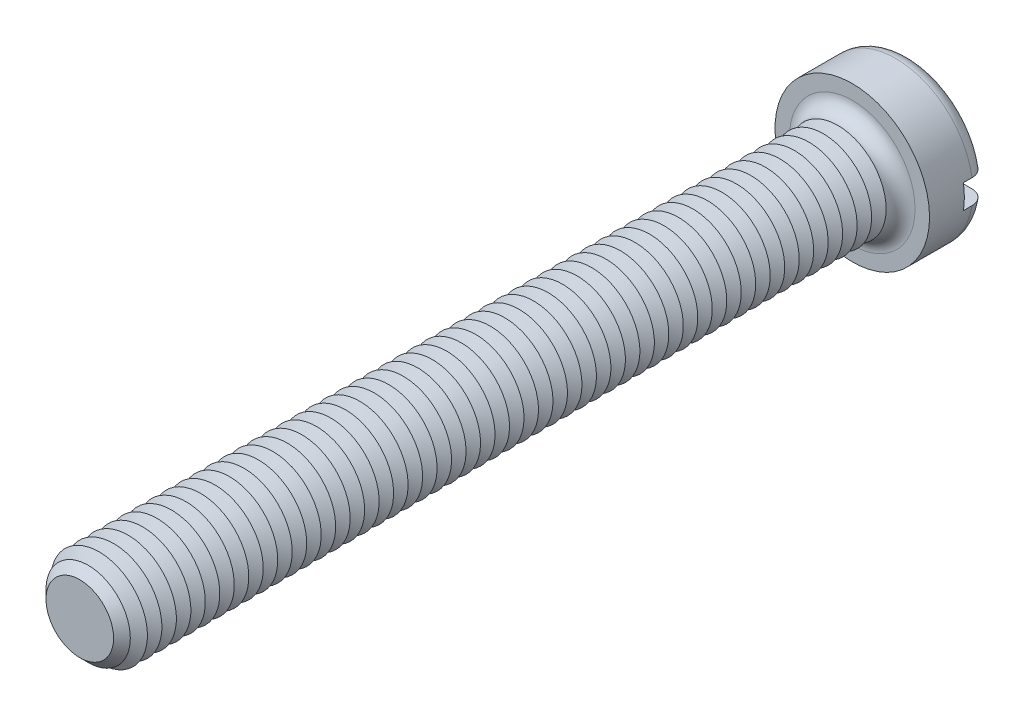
ISO-10303-21;
HEADER;
FILE_DESCRIPTION(('STEP AP214'),'2;1');
FILE_NAME('part.step','',(''),(''),'','','');
FILE_SCHEMA(('AUTOMOTIVE_DESIGN { 1 0 10303 214 1 1 1 1 }'));
ENDSEC;
DATA;
#1=APPLICATION_CONTEXT('core data for automotive mechanical design processes');
#2=APPLICATION_PROTOCOL_DEFINITION('international standard','automotive_design',2000,#1);
#3=PRODUCT_CONTEXT('',#1,'mechanical');
#4=PRODUCT('Part','Part','',(#3));
#5=PRODUCT_RELATED_PRODUCT_CATEGORY('part','',(#4));
#6=PRODUCT_DEFINITION_FORMATION('','',#4);
#7=PRODUCT_DEFINITION_CONTEXT('part definition',#1,'design');
#8=PRODUCT_DEFINITION('design','',#6,#7);
#9=PRODUCT_DEFINITION_SHAPE('','',#8);
#10=(LENGTH_UNIT() NAMED_UNIT(*) SI_UNIT(.MILLI.,.METRE.));
#11=(NAMED_UNIT(*) PLANE_ANGLE_UNIT() SI_UNIT($,.RADIAN.));
#12=(NAMED_UNIT(*) SI_UNIT($,.STERADIAN.) SOLID_ANGLE_UNIT());
#13=UNCERTAINTY_MEASURE_WITH_UNIT(LENGTH_MEASURE(1.E-05),#10,'distance_accuracy_value','');
#14=(GEOMETRIC_REPRESENTATION_CONTEXT(3) GLOBAL_UNCERTAINTY_ASSIGNED_CONTEXT((#13)) GLOBAL_UNIT_ASSIGNED_CONTEXT((#10,
#11,#12)) REPRESENTATION_CONTEXT('',''));
#15=CARTESIAN_POINT('',(0.,0.,0.));
#16=DIRECTION('',(0.,0.,1.));
#17=DIRECTION('',(1.,0.,0.));
#18=AXIS2_PLACEMENT_3D('',#15,#16,#17);
#19=CARTESIAN_POINT('',(0.,0.,-6.));
#20=DIRECTION('',(0.,0.,1.));
#21=DIRECTION('',(1.,0.,0.));
#22=AXIS2_PLACEMENT_3D('',#19,#20,#21);
#23=PLANE('',#22);
#24=CARTESIAN_POINT('',(0.,0.,-6.));
#25=DIRECTION('',(0.,0.,1.));
#26=DIRECTION('',(1.,0.,0.));
#27=AXIS2_PLACEMENT_3D('',#24,#25,#26);
#28=CIRCLE('',#27,6.5);
#29=CARTESIAN_POINT('',(-6.37867541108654,1.25,-6.));
#30=VERTEX_POINT('',#29);
#31=CARTESIAN_POINT('',(6.37867541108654,1.25,-6.));
#32=VERTEX_POINT('',#31);
#33=EDGE_CURVE('E116',#30,#32,#28,.F.);
#34=ORIENTED_EDGE('',*,*,#33,.T.);
#35=DIRECTION('',(1.,0.,0.));
#36=VECTOR('',#35,1.);
#37=CARTESIAN_POINT('',(-8.,1.25,-6.));
#38=LINE('',#37,#36);
#39=EDGE_CURVE('E111',#30,#32,#38,.T.);
#40=ORIENTED_EDGE('',*,*,#39,.F.);
#41=EDGE_LOOP('',(#34,#40));
#42=FACE_BOUND('',#41,.T.);
#43=ADVANCED_FACE('F39',(#42),#23,.F.);
#44=CARTESIAN_POINT('',(0.,0.,-4.5));
#45=DIRECTION('',(0.,0.,1.));
#46=DIRECTION('',(1.,0.,0.));
#47=AXIS2_PLACEMENT_3D('',#44,#45,#46);
#48=TOROIDAL_SURFACE('',#47,6.5,1.5);
#49=CARTESIAN_POINT('',(-7.63778128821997,1.25,-5.34492908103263));
#50=CARTESIAN_POINT('',(-7.58949199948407,1.25,-5.41482553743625));
#51=CARTESIAN_POINT('',(-7.53520056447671,1.25,-5.48065698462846));
#52=CARTESIAN_POINT('',(-7.41624971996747,1.25,-5.60228223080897));
#53=CARTESIAN_POINT('',(-7.35157642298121,1.25,-5.65806236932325));
#54=CARTESIAN_POINT('',(-7.21387612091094,1.25,-5.75795436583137));
#55=CARTESIAN_POINT('',(-7.14085828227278,1.25,-5.80207885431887));
#56=CARTESIAN_POINT('',(-6.98853766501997,1.25,-5.87758013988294));
#57=CARTESIAN_POINT('',(-6.90923642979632,1.25,-5.90896005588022));
#58=CARTESIAN_POINT('',(-6.74565677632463,1.25,-5.95849861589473));
#59=CARTESIAN_POINT('',(-6.66133328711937,1.25,-5.97650838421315));
#60=CARTESIAN_POINT('',(-6.49086565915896,1.25,-5.99833509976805));
#61=CARTESIAN_POINT('',(-6.40472129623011,1.25,-6.00215028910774));
#62=CARTESIAN_POINT('',(-6.23174891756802,1.25,-5.99550457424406));
#63=CARTESIAN_POINT('',(-6.14492874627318,1.25,-5.98483870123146));
#64=CARTESIAN_POINT('',(-5.97427268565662,1.25,-5.94920077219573));
#65=CARTESIAN_POINT('',(-5.89043699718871,1.25,-5.92422775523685));
#66=CARTESIAN_POINT('',(-5.72747580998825,1.25,-5.86041051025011));
#67=CARTESIAN_POINT('',(-5.64839123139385,1.25,-5.8214616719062));
#68=CARTESIAN_POINT('',(-5.49793182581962,1.25,-5.73076137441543));
#69=CARTESIAN_POINT('',(-5.42655700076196,1.25,-5.6790099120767));
#70=CARTESIAN_POINT('',(-5.29410028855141,1.25,-5.56444713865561));
#71=CARTESIAN_POINT('',(-5.23295591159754,1.25,-5.50170815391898));
#72=CARTESIAN_POINT('',(-5.12236155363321,1.25,-5.36664720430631));
#73=CARTESIAN_POINT('',(-5.07291010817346,1.25,-5.29432644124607));
#74=CARTESIAN_POINT('',(-4.98836421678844,1.25,-5.14389152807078));
#75=CARTESIAN_POINT('',(-4.95296843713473,1.25,-5.0659468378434));
#76=CARTESIAN_POINT('',(-4.89620356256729,1.25,-4.90510804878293));
#77=CARTESIAN_POINT('',(-4.87483169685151,1.25,-4.82221493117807));
#78=CARTESIAN_POINT('',(-4.8472995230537,1.25,-4.65636387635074));
#79=CARTESIAN_POINT('',(-4.84072446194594,1.25,-4.57347463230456));
#80=CARTESIAN_POINT('',(-4.84179430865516,1.25,-4.40779255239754));
#81=CARTESIAN_POINT('',(-4.84943782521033,1.25,-4.32499970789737));
#82=CARTESIAN_POINT('',(-4.87846819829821,1.25,-4.16301415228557));
#83=CARTESIAN_POINT('',(-4.89966978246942,1.25,-4.08378809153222));
#84=CARTESIAN_POINT('',(-4.95491528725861,1.25,-3.92995334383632));
#85=CARTESIAN_POINT('',(-4.98895983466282,1.25,-3.85534488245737));
#86=CARTESIAN_POINT('',(-5.06928242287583,1.25,-3.71183790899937));
#87=CARTESIAN_POINT('',(-5.11570495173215,1.25,-3.64302036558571));
#88=CARTESIAN_POINT('',(-5.21915370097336,1.25,-3.51388372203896));
#89=CARTESIAN_POINT('',(-5.27618132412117,1.25,-3.45356574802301));
#90=CARTESIAN_POINT('',(-5.40090076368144,1.25,-3.34137671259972));
#91=CARTESIAN_POINT('',(-5.46884305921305,1.25,-3.28978408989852));
#92=CARTESIAN_POINT('',(-5.61225757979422,1.25,-3.19841811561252));
#93=CARTESIAN_POINT('',(-5.68773079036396,1.25,-3.15864631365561));
#94=CARTESIAN_POINT('',(-5.84602026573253,1.25,-3.09111626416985));
#95=CARTESIAN_POINT('',(-5.92896901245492,1.25,-3.06366820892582));
#96=CARTESIAN_POINT('',(-6.09827849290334,1.25,-3.02294686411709));
#97=CARTESIAN_POINT('',(-6.18463944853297,1.25,-3.00967449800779));
#98=CARTESIAN_POINT('',(-6.35914138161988,1.25,-2.99765063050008));
#99=CARTESIAN_POINT('',(-6.4472913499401,1.25,-2.99902877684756));
#100=CARTESIAN_POINT('',(-6.62209547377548,1.25,-3.01665363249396));
#101=CARTESIAN_POINT('',(-6.70874965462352,1.25,-3.03290008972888));
#102=CARTESIAN_POINT('',(-6.87754008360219,1.25,-3.07975247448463));
#103=CARTESIAN_POINT('',(-6.95969991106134,1.25,-3.11027336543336));
#104=CARTESIAN_POINT('',(-7.11762200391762,1.25,-3.18486653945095));
#105=CARTESIAN_POINT('',(-7.19338469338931,1.25,-3.22893792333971));
#106=CARTESIAN_POINT('',(-7.33522754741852,1.25,-3.32873457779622));
#107=CARTESIAN_POINT('',(-7.40142768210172,1.25,-3.38428930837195));
#108=CARTESIAN_POINT('',(-7.52338344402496,1.25,-3.50587739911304));
#109=CARTESIAN_POINT('',(-7.5791399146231,1.25,-3.57190991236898));
#110=CARTESIAN_POINT('',(-7.67774856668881,1.25,-3.71151097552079));
#111=CARTESIAN_POINT('',(-7.72078137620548,1.25,-3.7849519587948));
#112=CARTESIAN_POINT('',(-7.79373860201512,1.25,-3.93807617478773));
#113=CARTESIAN_POINT('',(-7.82366445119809,1.25,-4.01775872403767));
#114=CARTESIAN_POINT('',(-7.86922494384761,1.25,-4.1801114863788));
#115=CARTESIAN_POINT('',(-7.88502105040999,1.25,-4.26273642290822));
#116=CARTESIAN_POINT('',(-7.90243332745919,1.25,-4.42948977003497));
#117=CARTESIAN_POINT('',(-7.90404643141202,1.25,-4.51361850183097));
#118=CARTESIAN_POINT('',(-7.89306914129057,1.25,-4.68049925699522));
#119=CARTESIAN_POINT('',(-7.88055163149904,1.25,-4.76325613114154));
#120=CARTESIAN_POINT('',(-7.84181179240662,1.25,-4.92542124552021));
#121=CARTESIAN_POINT('',(-7.81560657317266,1.25,-5.00483353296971));
#122=CARTESIAN_POINT('',(-7.76329893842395,1.25,-5.12766777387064));
#123=CARTESIAN_POINT('',(-7.74127773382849,1.25,-5.17287245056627));
#124=CARTESIAN_POINT('',(-7.69279783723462,1.25,-5.26083500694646));
#125=CARTESIAN_POINT('',(-7.66633917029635,1.25,-5.30359290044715));
#126=CARTESIAN_POINT('',(-7.63778128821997,1.25,-5.34492908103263));
#127=B_SPLINE_CURVE_WITH_KNOTS('',3,(#49,#50,#51,#52,#53,#54,#55,#56,#57,#58,#59,#60,#61,#62,
#63,#64,#65,#66,#67,#68,#69,#70,#71,#72,#73,#74,#75,#76,#77,#78,#79,#80,#81,#82,#83,#84,#85,#86,
#87,#88,#89,#90,#91,#92,#93,#94,#95,#96,#97,#98,#99,#100,#101,#102,#103,#104,#105,#106,#107,
#108,#109,#110,#111,#112,#113,#114,#115,#116,#117,#118,#119,#120,#121,#122,#123,#124,#125,#126),
.UNSPECIFIED.,.T.,.F.,(4,2,2,2,2,2,2,2,2,2,2,2,2,2,2,2,2,2,2,2,2,2,2,2,2,2,2,2,2,2,2,2,2,2,2,2,
2,2,4),(0.,0.254678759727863,0.509701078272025,0.764445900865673,1.01912834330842,
1.27660578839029,1.53411511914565,1.7953075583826,2.05651754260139,2.31972495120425,
2.58293242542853,2.84446831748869,3.10597143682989,3.36151874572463,3.61701554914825,
3.86525656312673,4.11347328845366,4.35836855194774,4.60327576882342,4.8511774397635,
5.0991119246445,5.35387584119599,5.60867314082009,5.86956650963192,6.13047687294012,
6.39369803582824,6.65691473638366,6.91858297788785,7.18023385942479,7.43824706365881,
7.69623942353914,7.95037087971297,8.20447454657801,8.45563599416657,8.70685174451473,
8.95677764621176,9.20639187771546,9.35700761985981,9.50762251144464),.UNSPECIFIED.);
#128=CARTESIAN_POINT('',(-7.90174031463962,1.25,-4.50000000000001));
#129=VERTEX_POINT('',#128);
#130=EDGE_CURVE('E600',#129,#30,#127,.T.);
#131=ORIENTED_EDGE('',*,*,#130,.F.);
#132=CARTESIAN_POINT('',(0.,0.,-4.5));
#133=DIRECTION('',(0.,0.,1.));
#134=DIRECTION('',(1.,0.,0.));
#135=AXIS2_PLACEMENT_3D('',#132,#133,#134);
#136=CIRCLE('',#135,8.);
#137=CARTESIAN_POINT('',(7.90174031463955,1.25,-4.5));
#138=VERTEX_POINT('',#137);
#139=EDGE_CURVE('E124',#138,#129,#136,.T.);
#140=ORIENTED_EDGE('',*,*,#139,.F.);
#141=CARTESIAN_POINT('',(4.95236709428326,1.25,-5.05808354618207));
#142=CARTESIAN_POINT('',(4.98477386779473,1.25,-5.13646278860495));
#143=CARTESIAN_POINT('',(5.02397623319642,1.25,-5.21210974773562));
#144=CARTESIAN_POINT('',(5.11464829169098,1.25,-5.35575180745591));
#145=CARTESIAN_POINT('',(5.16613670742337,1.25,-5.42373499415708));
#146=CARTESIAN_POINT('',(5.27963080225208,1.25,-5.55005899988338));
#147=CARTESIAN_POINT('',(5.34161871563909,1.25,-5.60841578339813));
#148=CARTESIAN_POINT('',(5.47431803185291,1.25,-5.71412381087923));
#149=CARTESIAN_POINT('',(5.545027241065,1.25,-5.76147781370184));
#150=CARTESIAN_POINT('',(5.69469818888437,1.25,-5.84486022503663));
#151=CARTESIAN_POINT('',(5.77379661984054,1.25,-5.88064336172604));
#152=CARTESIAN_POINT('',(5.93682776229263,1.25,-5.93863952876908));
#153=CARTESIAN_POINT('',(6.02076112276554,1.25,-5.96085073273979));
#154=CARTESIAN_POINT('',(6.19235911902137,1.25,-5.99130732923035));
#155=CARTESIAN_POINT('',(6.2800597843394,1.25,-5.99935025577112));
#156=CARTESIAN_POINT('',(6.45556807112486,1.25,-6.00057400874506));
#157=CARTESIAN_POINT('',(6.54337569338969,1.25,-5.99375472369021));
#158=CARTESIAN_POINT('',(6.71642471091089,1.25,-5.96539034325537));
#159=CARTESIAN_POINT('',(6.8016703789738,1.25,-5.94387137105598));
#160=CARTESIAN_POINT('',(6.96726399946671,1.25,-5.8866508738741));
#161=CARTESIAN_POINT('',(7.04761223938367,1.25,-5.85095018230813));
#162=CARTESIAN_POINT('',(7.2000703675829,1.25,-5.7668235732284));
#163=CARTESIAN_POINT('',(7.27226868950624,1.25,-5.71855796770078));
#164=CARTESIAN_POINT('',(7.40737382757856,1.25,-5.61041520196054));
#165=CARTESIAN_POINT('',(7.47028138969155,1.25,-5.55053897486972));
#166=CARTESIAN_POINT('',(7.5840004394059,1.25,-5.42185995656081));
#167=CARTESIAN_POINT('',(7.63498189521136,1.25,-5.35320736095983));
#168=CARTESIAN_POINT('',(7.72451646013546,1.25,-5.20822613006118));
#169=CARTESIAN_POINT('',(7.76307051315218,1.25,-5.13189807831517));
#170=CARTESIAN_POINT('',(7.82615156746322,1.25,-4.97479919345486));
#171=CARTESIAN_POINT('',(7.85085353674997,1.25,-4.89409858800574));
#172=CARTESIAN_POINT('',(7.88624162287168,1.25,-4.72968126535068));
#173=CARTESIAN_POINT('',(7.89692844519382,1.25,-4.64596470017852));
#174=CARTESIAN_POINT('',(7.90393395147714,1.25,-4.47857496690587));
#175=CARTESIAN_POINT('',(7.900361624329,1.25,-4.39490633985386));
#176=CARTESIAN_POINT('',(7.8792027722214,1.25,-4.22936201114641));
#177=CARTESIAN_POINT('',(7.86161649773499,1.25,-4.14748627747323));
#178=CARTESIAN_POINT('',(7.81298565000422,1.25,-3.98793539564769));
#179=CARTESIAN_POINT('',(7.78195585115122,1.25,-3.91025574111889));
#180=CARTESIAN_POINT('',(7.70736418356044,1.25,-3.76116938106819));
#181=CARTESIAN_POINT('',(7.66380211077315,1.25,-3.68976277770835));
#182=CARTESIAN_POINT('',(7.56515173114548,1.25,-3.55480889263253));
#183=CARTESIAN_POINT('',(7.51000119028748,1.25,-3.49130712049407));
#184=CARTESIAN_POINT('',(7.38992820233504,1.25,-3.3743390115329));
#185=CARTESIAN_POINT('',(7.32500529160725,1.25,-3.32087315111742));
#186=CARTESIAN_POINT('',(7.18646521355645,1.25,-3.22483712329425));
#187=CARTESIAN_POINT('',(7.11275872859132,1.25,-3.18239583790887));
#188=CARTESIAN_POINT('',(6.95934489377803,1.25,-3.11028530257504));
#189=CARTESIAN_POINT('',(6.87963710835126,1.25,-3.08061698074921));
#190=CARTESIAN_POINT('',(6.71523243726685,1.25,-3.03442872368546));
#191=CARTESIAN_POINT('',(6.63047940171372,1.25,-3.0181086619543));
#192=CARTESIAN_POINT('',(6.45944163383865,1.25,-2.99971307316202));
#193=CARTESIAN_POINT('',(6.37315677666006,1.25,-2.99763871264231));
#194=CARTESIAN_POINT('',(6.20021063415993,1.25,-3.00779604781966));
#195=CARTESIAN_POINT('',(6.11356117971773,1.25,-3.02022976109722));
#196=CARTESIAN_POINT('',(5.94354092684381,1.25,-3.05935975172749));
#197=CARTESIAN_POINT('',(5.86017035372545,1.25,-3.08605700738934));
#198=CARTESIAN_POINT('',(5.69848536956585,1.25,-3.15322746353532));
#199=CARTESIAN_POINT('',(5.62021039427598,1.25,-3.1937956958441));
#200=CARTESIAN_POINT('',(5.47164170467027,1.25,-3.28758816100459));
#201=CARTESIAN_POINT('',(5.40134797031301,1.25,-3.3408123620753));
#202=CARTESIAN_POINT('',(5.27136483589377,1.25,-3.45806317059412));
#203=CARTESIAN_POINT('',(5.21160120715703,1.25,-3.52200740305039));
#204=CARTESIAN_POINT('',(5.10396941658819,1.25,-3.65922833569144));
#205=CARTESIAN_POINT('',(5.05609917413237,1.25,-3.73250340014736));
#206=CARTESIAN_POINT('',(4.97487058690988,1.25,-3.8844714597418));
#207=CARTESIAN_POINT('',(4.94119529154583,1.25,-3.96299495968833));
#208=CARTESIAN_POINT('',(4.88793322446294,1.25,-4.12470694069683));
#209=CARTESIAN_POINT('',(4.86834741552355,1.25,-4.20789574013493));
#210=CARTESIAN_POINT('',(4.84433446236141,1.25,-4.3740749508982));
#211=CARTESIAN_POINT('',(4.83950391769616,1.25,-4.45700748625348));
#212=CARTESIAN_POINT('',(4.84404021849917,1.25,-4.62240731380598));
#213=CARTESIAN_POINT('',(4.85338770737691,1.25,-4.70487508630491));
#214=CARTESIAN_POINT('',(4.87895619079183,1.25,-4.83246978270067));
#215=CARTESIAN_POINT('',(4.89056704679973,1.25,-4.87856970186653));
#216=CARTESIAN_POINT('',(4.91819711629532,1.25,-4.96942661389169));
#217=CARTESIAN_POINT('',(4.93421619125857,1.25,-5.01418364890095));
#218=CARTESIAN_POINT('',(4.95236709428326,1.25,-5.05808354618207));
#219=B_SPLINE_CURVE_WITH_KNOTS('',3,(#141,#142,#143,#144,#145,#146,#147,#148,#149,#150,#151,
#152,#153,#154,#155,#156,#157,#158,#159,#160,#161,#162,#163,#164,#165,#166,#167,#168,#169,#170,
#171,#172,#173,#174,#175,#176,#177,#178,#179,#180,#181,#182,#183,#184,#185,#186,#187,#188,#189,
#190,#191,#192,#193,#194,#195,#196,#197,#198,#199,#200,#201,#202,#203,#204,#205,#206,#207,#208,
#209,#210,#211,#212,#213,#214,#215,#216,#217,#218),.UNSPECIFIED.,.T.,.F.,(4,2,2,2,2,2,2,2,2,2,2,
2,2,2,2,2,2,2,2,2,2,2,2,2,2,2,2,2,2,2,2,2,2,2,2,2,2,2,4),(0.,0.25426396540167,0.508917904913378,
0.763145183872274,1.01730864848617,1.27655188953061,1.53583000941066,1.79878406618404,
2.06174009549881,2.32423003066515,2.5867045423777,2.84598168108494,3.10523799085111,
3.36053725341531,3.61581712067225,3.8677953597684,4.11976091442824,4.36980428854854,
4.61984319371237,4.86960800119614,5.11937687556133,5.37052303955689,5.62168112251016,
5.87565515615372,6.12964764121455,6.38737709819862,6.64512765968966,6.90651052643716,
7.16791132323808,7.43114013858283,7.69436829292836,7.95565940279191,8.21690477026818,
8.47196060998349,8.72703387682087,8.97506819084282,9.22276418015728,9.36518087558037,
9.50759309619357),.UNSPECIFIED.);
#220=EDGE_CURVE('E602',#32,#138,#219,.T.);
#221=ORIENTED_EDGE('',*,*,#220,.F.);
#222=ORIENTED_EDGE('',*,*,#33,.F.);
#223=EDGE_LOOP('',(#131,#140,#221,#222));
#224=FACE_BOUND('',#223,.T.);
#225=ADVANCED_FACE('F584',(#224),#48,.T.);
#226=CARTESIAN_POINT('',(0.,0.,-6.));
#227=DIRECTION('',(0.,0.,1.));
#228=DIRECTION('',(1.,0.,0.));
#229=AXIS2_PLACEMENT_3D('',#226,#227,#228);
#230=CYLINDRICAL_SURFACE('',#229,8.);
#231=DIRECTION('',(0.,0.,1.));
#232=VECTOR('',#231,1.);
#233=CARTESIAN_POINT('',(7.90174031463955,1.25,-6.));
#234=LINE('',#233,#232);
#235=CARTESIAN_POINT('',(7.90174031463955,1.25,-3.6));
#236=VERTEX_POINT('',#235);
#237=EDGE_CURVE('E618',#138,#236,#234,.T.);
#238=ORIENTED_EDGE('',*,*,#237,.F.);
#239=ORIENTED_EDGE('',*,*,#139,.T.);
#240=DIRECTION('',(0.,0.,1.));
#241=VECTOR('',#240,1.);
#242=CARTESIAN_POINT('',(-7.90174031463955,1.25,-6.));
#243=LINE('',#242,#241);
#244=CARTESIAN_POINT('',(-7.90174031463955,1.25,-3.6));
#245=VERTEX_POINT('',#244);
#246=EDGE_CURVE('E63',#245,#129,#243,.F.);
#247=ORIENTED_EDGE('',*,*,#246,.F.);
#248=CARTESIAN_POINT('',(0.,0.,-3.6));
#249=DIRECTION('',(0.,0.,-1.));
#250=DIRECTION('',(-1.,0.,0.));
#251=AXIS2_PLACEMENT_3D('',#248,#249,#250);
#252=CIRCLE('',#251,8.);
#253=CARTESIAN_POINT('',(-7.90174031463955,-1.25,-3.6));
#254=VERTEX_POINT('',#253);
#255=EDGE_CURVE('E43',#245,#254,#252,.F.);
#256=ORIENTED_EDGE('',*,*,#255,.T.);
#257=DIRECTION('',(0.,0.,1.));
#258=VECTOR('',#257,1.);
#259=CARTESIAN_POINT('',(-7.90174031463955,-1.25,-6.));
#260=LINE('',#259,#258);
#261=CARTESIAN_POINT('',(-7.9017403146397,-1.25,-4.49999999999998));
#262=VERTEX_POINT('',#261);
#263=EDGE_CURVE('E615',#262,#254,#260,.T.);
#264=ORIENTED_EDGE('',*,*,#263,.F.);
#265=CARTESIAN_POINT('',(7.90174031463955,-1.25,-4.5));
#266=VERTEX_POINT('',#265);
#267=EDGE_CURVE('E126',#262,#266,#136,.T.);
#268=ORIENTED_EDGE('',*,*,#267,.T.);
#269=DIRECTION('',(0.,0.,1.));
#270=VECTOR('',#269,1.);
#271=CARTESIAN_POINT('',(7.90174031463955,-1.25,-6.));
#272=LINE('',#271,#270);
#273=CARTESIAN_POINT('',(7.90174031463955,-1.25,-3.6));
#274=VERTEX_POINT('',#273);
#275=EDGE_CURVE('E55',#274,#266,#272,.F.);
#276=ORIENTED_EDGE('',*,*,#275,.F.);
#277=EDGE_CURVE('E11',#274,#236,#252,.F.);
#278=ORIENTED_EDGE('',*,*,#277,.T.);
#279=EDGE_LOOP('',(#238,#239,#247,#256,#264,#268,#276,#278));
#280=FACE_BOUND('',#279,.T.);
#281=CARTESIAN_POINT('',(0.,0.,0.));
#282=DIRECTION('',(0.,0.,1.));
#283=DIRECTION('',(1.,0.,0.));
#284=AXIS2_PLACEMENT_3D('',#281,#282,#283);
#285=CIRCLE('',#284,8.);
#286=CARTESIAN_POINT('',(8.,0.,0.));
#287=VERTEX_POINT('',#286);
#288=EDGE_CURVE('E621',#287,#287,#285,.T.);
#289=ORIENTED_EDGE('',*,*,#288,.F.);
#290=EDGE_LOOP('',(#289));
#291=FACE_BOUND('',#290,.T.);
#292=ADVANCED_FACE('F580',(#280,#291),#230,.T.);
#293=CARTESIAN_POINT('',(6.37867541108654,-1.25,-6.));
#294=VERTEX_POINT('',#293);
#295=CARTESIAN_POINT('',(-6.37867541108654,-1.25,-6.));
#296=VERTEX_POINT('',#295);
#297=EDGE_CURVE('E109',#294,#296,#28,.F.);
#298=ORIENTED_EDGE('',*,*,#297,.T.);
#299=DIRECTION('',(-1.,0.,0.));
#300=VECTOR('',#299,1.);
#301=CARTESIAN_POINT('',(-8.,-1.25,-6.));
#302=LINE('',#301,#300);
#303=EDGE_CURVE('E96',#294,#296,#302,.T.);
#304=ORIENTED_EDGE('',*,*,#303,.F.);
#305=EDGE_LOOP('',(#298,#304));
#306=FACE_BOUND('',#305,.T.);
#307=ADVANCED_FACE('F108',(#306),#23,.F.);
#308=CARTESIAN_POINT('',(0.,0.,0.));
#309=DIRECTION('',(0.,0.,1.));
#310=DIRECTION('',(1.,0.,0.));
#311=AXIS2_PLACEMENT_3D('',#308,#309,#310);
#312=PLANE('',#311);
#313=CARTESIAN_POINT('',(0.,0.,0.));
#314=DIRECTION('',(0.,0.,1.));
#315=DIRECTION('',(1.,0.,0.));
#316=AXIS2_PLACEMENT_3D('',#313,#314,#315);
#317=CIRCLE('',#316,6.5);
#318=CARTESIAN_POINT('',(6.5,0.,0.));
#319=VERTEX_POINT('',#318);
#320=EDGE_CURVE('E115',#319,#319,#317,.F.);
#321=ORIENTED_EDGE('',*,*,#320,.T.);
#322=EDGE_LOOP('',(#321));
#323=FACE_BOUND('',#322,.T.);
#324=ORIENTED_EDGE('',*,*,#288,.T.);
#325=EDGE_LOOP('',(#324));
#326=FACE_BOUND('',#325,.T.);
#327=ADVANCED_FACE('F579',(#323,#326),#312,.T.);
#328=CARTESIAN_POINT('',(-7.63778128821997,-1.25,-5.34492908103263));
#329=CARTESIAN_POINT('',(-7.68527581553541,-1.25,-5.27616964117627));
#330=CARTESIAN_POINT('',(-7.72703224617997,-1.25,-5.20337764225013));
#331=CARTESIAN_POINT('',(-7.79778035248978,-1.25,-5.05176511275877));
#332=CARTESIAN_POINT('',(-7.82675823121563,-1.25,-4.97293817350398));
#333=CARTESIAN_POINT('',(-7.87103239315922,-1.25,-4.81153865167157));
#334=CARTESIAN_POINT('',(-7.8863313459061,-1.25,-4.72896680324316));
#335=CARTESIAN_POINT('',(-7.90278562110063,-1.25,-4.56244566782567));
#336=CARTESIAN_POINT('',(-7.90394420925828,-1.25,-4.4784967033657));
#337=CARTESIAN_POINT('',(-7.89211470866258,-1.25,-4.31190980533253));
#338=CARTESIAN_POINT('',(-7.87917806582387,-1.25,-4.22926821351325));
#339=CARTESIAN_POINT('',(-7.8396278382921,-1.25,-4.06732477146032));
#340=CARTESIAN_POINT('',(-7.81301388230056,-1.25,-3.98802301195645));
#341=CARTESIAN_POINT('',(-7.74686575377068,-1.25,-3.83490116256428));
#342=CARTESIAN_POINT('',(-7.70731700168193,-1.25,-3.76108737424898));
#343=CARTESIAN_POINT('',(-7.61647675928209,-1.25,-3.62108231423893));
#344=CARTESIAN_POINT('',(-7.56518496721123,-1.25,-3.55489123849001));
#345=CARTESIAN_POINT('',(-7.45192141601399,-1.25,-3.43145488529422));
#346=CARTESIAN_POINT('',(-7.3898717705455,-1.25,-3.37428109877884));
#347=CARTESIAN_POINT('',(-7.25715883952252,-1.25,-3.27100737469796));
#348=CARTESIAN_POINT('',(-7.18649507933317,-1.25,-3.22490804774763));
#349=CARTESIAN_POINT('',(-7.03760898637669,-1.25,-3.14445316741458));
#350=CARTESIAN_POINT('',(-6.95930204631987,-1.25,-3.1102542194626));
#351=CARTESIAN_POINT('',(-6.79811453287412,-1.25,-3.05526915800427));
#352=CARTESIAN_POINT('',(-6.71523359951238,-1.25,-3.03448410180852));
#353=CARTESIAN_POINT('',(-6.5459165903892,-1.25,-3.006592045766));
#354=CARTESIAN_POINT('',(-6.45944575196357,-1.25,-2.99969602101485));
#355=CARTESIAN_POINT('',(-6.28655568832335,-1.25,-3.00032465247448));
#356=CARTESIAN_POINT('',(-6.20013646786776,-1.25,-3.00785047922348));
#357=CARTESIAN_POINT('',(-6.02865505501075,-1.25,-3.03725742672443));
#358=CARTESIAN_POINT('',(-5.94362352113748,-1.25,-3.05931758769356));
#359=CARTESIAN_POINT('',(-5.77844448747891,-1.25,-3.11735373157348));
#360=CARTESIAN_POINT('',(-5.69829723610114,-1.25,-3.15333042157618));
#361=CARTESIAN_POINT('',(-5.54495924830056,-1.25,-3.23837037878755));
#362=CARTESIAN_POINT('',(-5.47178958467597,-1.25,-3.28747168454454));
#363=CARTESIAN_POINT('',(-5.33486536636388,-1.25,-3.39741183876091));
#364=CARTESIAN_POINT('',(-5.27111040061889,-1.25,-3.45825017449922));
#365=CARTESIAN_POINT('',(-5.15579778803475,-1.25,-3.58914722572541));
#366=CARTESIAN_POINT('',(-5.10409113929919,-1.25,-3.65907455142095));
#367=CARTESIAN_POINT('',(-5.01353659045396,-1.25,-3.8068142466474));
#368=CARTESIAN_POINT('',(-4.97468647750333,-1.25,-3.88462525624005));
#369=CARTESIAN_POINT('',(-4.91208858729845,-1.25,-4.04366636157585));
#370=CARTESIAN_POINT('',(-4.88795969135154,-1.25,-4.12474643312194));
#371=CARTESIAN_POINT('',(-4.85404909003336,-1.25,-4.28985038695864));
#372=CARTESIAN_POINT('',(-4.84426486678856,-1.25,-4.37387374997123));
#373=CARTESIAN_POINT('',(-4.83946276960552,-1.25,-4.54023897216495));
#374=CARTESIAN_POINT('',(-4.8440833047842,-1.25,-4.62257060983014));
#375=CARTESIAN_POINT('',(-4.86713763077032,-1.25,-4.78527148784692));
#376=CARTESIAN_POINT('',(-4.88557092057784,-1.25,-4.86564079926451));
#377=CARTESIAN_POINT('',(-4.9355229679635,-1.25,-5.02189555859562));
#378=CARTESIAN_POINT('',(-4.9669975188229,-1.25,-5.09779517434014));
#379=CARTESIAN_POINT('',(-5.04199393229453,-1.25,-5.24338322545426));
#380=CARTESIAN_POINT('',(-5.0855168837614,-1.25,-5.31307109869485));
#381=CARTESIAN_POINT('',(-5.18427540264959,-1.25,-5.44580979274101));
#382=CARTESIAN_POINT('',(-5.2397318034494,-1.25,-5.50869620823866));
#383=CARTESIAN_POINT('',(-5.36015301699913,-1.25,-5.62458635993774));
#384=CARTESIAN_POINT('',(-5.42511919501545,-1.25,-5.67758867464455));
#385=CARTESIAN_POINT('',(-5.56469412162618,-1.25,-5.7737610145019));
#386=CARTESIAN_POINT('',(-5.6395232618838,-1.25,-5.81661133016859));
#387=CARTESIAN_POINT('',(-5.79521544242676,-1.25,-5.8894110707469));
#388=CARTESIAN_POINT('',(-5.8760791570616,-1.25,-5.91935905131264));
#389=CARTESIAN_POINT('',(-6.04317815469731,-1.25,-5.9660059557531));
#390=CARTESIAN_POINT('',(-6.12948555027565,-1.25,-5.98244700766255));
#391=CARTESIAN_POINT('',(-6.30363462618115,-1.25,-6.00064866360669));
#392=CARTESIAN_POINT('',(-6.39147629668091,-1.25,-6.00240936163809));
#393=CARTESIAN_POINT('',(-6.5664192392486,-1.25,-5.9911248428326));
#394=CARTESIAN_POINT('',(-6.653518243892,-1.25,-5.9780442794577));
#395=CARTESIAN_POINT('',(-6.82426167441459,-1.25,-5.93729204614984));
#396=CARTESIAN_POINT('',(-6.90790538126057,-1.25,-5.90961735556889));
#397=CARTESIAN_POINT('',(-7.06846412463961,-1.25,-5.84071272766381));
#398=CARTESIAN_POINT('',(-7.14543542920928,-1.25,-5.79961377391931));
#399=CARTESIAN_POINT('',(-7.29116896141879,-1.25,-5.70491210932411));
#400=CARTESIAN_POINT('',(-7.35994165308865,-1.25,-5.65132560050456));
#401=CARTESIAN_POINT('',(-7.46362894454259,-1.25,-5.55509815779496));
#402=CARTESIAN_POINT('',(-7.50165191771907,-1.25,-5.51575032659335));
#403=CARTESIAN_POINT('',(-7.57319530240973,-1.25,-5.43315308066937));
#404=CARTESIAN_POINT('',(-7.60671575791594,-1.25,-5.38990370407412));
#405=CARTESIAN_POINT('',(-7.63778128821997,-1.25,-5.34492908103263));
#406=B_SPLINE_CURVE_WITH_KNOTS('',3,(#328,#329,#330,#331,#332,#333,#334,#335,#336,#337,#338,
#339,#340,#341,#342,#343,#344,#345,#346,#347,#348,#349,#350,#351,#352,#353,#354,#355,#356,#357,
#358,#359,#360,#361,#362,#363,#364,#365,#366,#367,#368,#369,#370,#371,#372,#373,#374,#375,#376,
#377,#378,#379,#380,#381,#382,#383,#384,#385,#386,#387,#388,#389,#390,#391,#392,#393,#394,#395,
#396,#397,#398,#399,#400,#401,#402,#403,#404,#405),.UNSPECIFIED.,.T.,.F.,(4,2,2,2,2,2,2,2,2,2,2,
2,2,2,2,2,2,2,2,2,2,2,2,2,2,2,2,2,2,2,2,2,2,2,2,2,2,2,4),(0.,0.250506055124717,
0.501281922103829,0.752008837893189,1.00267784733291,1.25243500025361,1.50219893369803,
1.75224536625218,2.00229822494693,2.25424343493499,2.50620253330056,2.76136198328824,
3.01654154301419,3.27556891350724,3.53461730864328,3.79691797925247,4.05923197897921,
4.32231463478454,4.5853858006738,4.84500678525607,5.10458306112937,5.3571172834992,
5.60960717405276,5.85581050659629,6.10200490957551,6.34737151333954,6.59276029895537,
6.84315522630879,7.09358613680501,7.35108485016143,7.60861238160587,7.87094926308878,
8.13328446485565,8.39624576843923,8.65926152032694,8.91978401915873,9.17997036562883,
9.34382460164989,9.50767723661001),.UNSPECIFIED.);
#407=EDGE_CURVE('E103',#296,#262,#406,.T.);
#408=ORIENTED_EDGE('',*,*,#407,.F.);
#409=ORIENTED_EDGE('',*,*,#297,.F.);
#410=CARTESIAN_POINT('',(4.95236709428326,-1.25,-5.05808354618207));
#411=CARTESIAN_POINT('',(4.92105512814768,-1.25,-4.98233216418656));
#412=CARTESIAN_POINT('',(4.89604361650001,-1.25,-4.90392040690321));
#413=CARTESIAN_POINT('',(4.85951223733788,-1.25,-4.74395758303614));
#414=CARTESIAN_POINT('',(4.8480045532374,-1.25,-4.66240375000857));
#415=CARTESIAN_POINT('',(4.83891469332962,-1.25,-4.49852199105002));
#416=CARTESIAN_POINT('',(4.84133145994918,-1.25,-4.41619412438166));
#417=CARTESIAN_POINT('',(4.8600038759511,-1.25,-4.25314313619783));
#418=CARTESIAN_POINT('',(4.87625705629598,-1.25,-4.17241973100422));
#419=CARTESIAN_POINT('',(4.92196554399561,-1.25,-4.01505032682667));
#420=CARTESIAN_POINT('',(4.95138456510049,-1.25,-3.93839376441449));
#421=CARTESIAN_POINT('',(5.02244158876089,-1.25,-3.79097367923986));
#422=CARTESIAN_POINT('',(5.06408092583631,-1.25,-3.72021080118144));
#423=CARTESIAN_POINT('',(5.15918188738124,-1.25,-3.5851203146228));
#424=CARTESIAN_POINT('',(5.21285223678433,-1.25,-3.5209397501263));
#425=CARTESIAN_POINT('',(5.32993512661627,-1.25,-3.40218700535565));
#426=CARTESIAN_POINT('',(5.39334903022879,-1.25,-3.34761617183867));
#427=CARTESIAN_POINT('',(5.5300552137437,-1.25,-3.24801679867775));
#428=CARTESIAN_POINT('',(5.60357647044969,-1.25,-3.20330242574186));
#429=CARTESIAN_POINT('',(5.75697062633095,-1.25,-3.1265687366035));
#430=CARTESIAN_POINT('',(5.83684424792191,-1.25,-3.09455086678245));
#431=CARTESIAN_POINT('',(6.00239031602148,-1.25,-3.04353393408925));
#432=CARTESIAN_POINT('',(6.08814636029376,-1.25,-3.02480570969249));
#433=CARTESIAN_POINT('',(6.26158564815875,-1.25,-3.00194915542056));
#434=CARTESIAN_POINT('',(6.34926896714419,-1.25,-2.997821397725));
#435=CARTESIAN_POINT('',(6.52441816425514,-1.25,-3.00435236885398));
#436=CARTESIAN_POINT('',(6.61188199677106,-1.25,-3.01506655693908));
#437=CARTESIAN_POINT('',(6.78373130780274,-1.25,-3.05116556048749));
#438=CARTESIAN_POINT('',(6.8681168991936,-1.25,-3.07654983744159));
#439=CARTESIAN_POINT('',(7.03056473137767,-1.25,-3.14105639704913));
#440=CARTESIAN_POINT('',(7.10867812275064,-1.25,-3.18004978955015));
#441=CARTESIAN_POINT('',(7.25711285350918,-1.25,-3.27078804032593));
#442=CARTESIAN_POINT('',(7.327434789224,-1.25,-3.32253192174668));
#443=CARTESIAN_POINT('',(7.45716954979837,-1.25,-3.4364775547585));
#444=CARTESIAN_POINT('',(7.51672925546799,-1.25,-3.49851206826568));
#445=CARTESIAN_POINT('',(7.62440498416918,-1.25,-3.63182557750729));
#446=CARTESIAN_POINT('',(7.67252193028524,-1.25,-3.70310382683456));
#447=CARTESIAN_POINT('',(7.75523498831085,-1.25,-3.8517825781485));
#448=CARTESIAN_POINT('',(7.79001407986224,-1.25,-3.92908131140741));
#449=CARTESIAN_POINT('',(7.84595474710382,-1.25,-4.08845836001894));
#450=CARTESIAN_POINT('',(7.86711715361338,-1.25,-4.1705363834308));
#451=CARTESIAN_POINT('',(7.89503817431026,-1.25,-4.3362768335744));
#452=CARTESIAN_POINT('',(7.90193595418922,-1.25,-4.41991584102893));
#453=CARTESIAN_POINT('',(7.90153623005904,-1.25,-4.58715860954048));
#454=CARTESIAN_POINT('',(7.89423915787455,-1.25,-4.67076237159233));
#455=CARTESIAN_POINT('',(7.86572271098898,-1.25,-4.83525080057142));
#456=CARTESIAN_POINT('',(7.84455307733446,-1.25,-4.91614410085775));
#457=CARTESIAN_POINT('',(7.78897430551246,-1.25,-5.0732444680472));
#458=CARTESIAN_POINT('',(7.75456511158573,-1.25,-5.1494515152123));
#459=CARTESIAN_POINT('',(7.67339923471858,-1.25,-5.29528903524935));
#460=CARTESIAN_POINT('',(7.62660424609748,-1.25,-5.36489817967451));
#461=CARTESIAN_POINT('',(7.52209201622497,-1.25,-5.49536318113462));
#462=CARTESIAN_POINT('',(7.4643743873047,-1.25,-5.55621872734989));
#463=CARTESIAN_POINT('',(7.33909994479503,-1.25,-5.66807257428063));
#464=CARTESIAN_POINT('',(7.27145672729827,-1.25,-5.71897407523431));
#465=CARTESIAN_POINT('',(7.12868060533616,-1.25,-5.80887807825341));
#466=CARTESIAN_POINT('',(7.0535472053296,-1.25,-5.84787979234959));
#467=CARTESIAN_POINT('',(6.89682225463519,-1.25,-5.91345911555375));
#468=CARTESIAN_POINT('',(6.81515596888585,-1.25,-5.93985808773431));
#469=CARTESIAN_POINT('',(6.64858434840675,-1.25,-5.97879449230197));
#470=CARTESIAN_POINT('',(6.56367874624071,-1.25,-5.99133077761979));
#471=CARTESIAN_POINT('',(6.39168259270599,-1.25,-6.00236627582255));
#472=CARTESIAN_POINT('',(6.30457835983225,-1.25,-6.00065255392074));
#473=CARTESIAN_POINT('',(6.13186422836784,-1.25,-5.98278857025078));
#474=CARTESIAN_POINT('',(6.04625438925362,-1.25,-5.96663773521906));
#475=CARTESIAN_POINT('',(5.87802521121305,-1.25,-5.92012173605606));
#476=CARTESIAN_POINT('',(5.79544617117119,-1.25,-5.88961066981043));
#477=CARTESIAN_POINT('',(5.63656223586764,-1.25,-5.81513349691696));
#478=CARTESIAN_POINT('',(5.56025908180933,-1.25,-5.77116367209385));
#479=CARTESIAN_POINT('',(5.4162607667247,-1.25,-5.67098882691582));
#480=CARTESIAN_POINT('',(5.34855795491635,-1.25,-5.61479480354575));
#481=CARTESIAN_POINT('',(5.22382615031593,-1.25,-5.49168804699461));
#482=CARTESIAN_POINT('',(5.16678340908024,-1.25,-5.42478932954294));
#483=CARTESIAN_POINT('',(5.08326589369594,-1.25,-5.3075481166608));
#484=CARTESIAN_POINT('',(5.05313168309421,-1.25,-5.25976959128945));
#485=CARTESIAN_POINT('',(4.99845900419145,-1.25,-5.16110869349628));
#486=CARTESIAN_POINT('',(4.9739204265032,-1.25,-5.11022638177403));
#487=CARTESIAN_POINT('',(4.95236709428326,-1.25,-5.05808354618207));
#488=B_SPLINE_CURVE_WITH_KNOTS('',3,(#410,#411,#412,#413,#414,#415,#416,#417,#418,#419,#420,
#421,#422,#423,#424,#425,#426,#427,#428,#429,#430,#431,#432,#433,#434,#435,#436,#437,#438,#439,
#440,#441,#442,#443,#444,#445,#446,#447,#448,#449,#450,#451,#452,#453,#454,#455,#456,#457,#458,
#459,#460,#461,#462,#463,#464,#465,#466,#467,#468,#469,#470,#471,#472,#473,#474,#475,#476,#477,
#478,#479,#480,#481,#482,#483,#484,#485,#486,#487),.UNSPECIFIED.,.T.,.F.,(4,2,2,2,2,2,2,2,2,2,2,
2,2,2,2,2,2,2,2,2,2,2,2,2,2,2,2,2,2,2,2,2,2,2,2,2,2,2,4),(0.,0.245701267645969,
0.491624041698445,0.737528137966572,0.983388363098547,1.22857510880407,1.47378864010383,
1.72364048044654,1.97352730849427,2.2304941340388,2.48749022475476,2.74958408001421,
3.01168820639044,3.2747743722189,3.53785088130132,3.79850056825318,4.05913029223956,
4.31587819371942,4.57260537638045,4.82567253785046,5.07872425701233,5.32929532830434,
5.57985877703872,5.82952869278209,6.07919966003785,6.32965199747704,6.58011322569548,
6.8329006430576,7.08570479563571,7.3419930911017,7.59830259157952,7.85844887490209,
8.11860548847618,8.38146435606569,8.64439590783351,8.90709189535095,9.16944670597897,
9.33857644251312,9.5077028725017),.UNSPECIFIED.);
#489=EDGE_CURVE('E92',#266,#294,#488,.T.);
#490=ORIENTED_EDGE('',*,*,#489,.F.);
#491=ORIENTED_EDGE('',*,*,#267,.F.);
#492=EDGE_LOOP('',(#408,#409,#490,#491));
#493=FACE_BOUND('',#492,.T.);
#494=ADVANCED_FACE('F113',(#493),#48,.T.);
#495=CARTESIAN_POINT('',(0.,0.,1.5));
#496=DIRECTION('',(0.,0.,1.));
#497=DIRECTION('',(1.,0.,0.));
#498=AXIS2_PLACEMENT_3D('',#495,#496,#497);
#499=TOROIDAL_SURFACE('',#498,6.5,1.5);
#500=ORIENTED_EDGE('',*,*,#320,.F.);
#501=EDGE_LOOP('',(#500));
#502=FACE_BOUND('',#501,.T.);
#503=CARTESIAN_POINT('',(0.,0.,1.5));
#504=DIRECTION('',(0.,0.,-1.));
#505=DIRECTION('',(-1.,0.,0.));
#506=AXIS2_PLACEMENT_3D('',#503,#504,#505);
#507=CIRCLE('',#506,5.);
#508=CARTESIAN_POINT('',(-5.,0.,1.5));
#509=VERTEX_POINT('',#508);
#510=EDGE_CURVE('E626',#509,#509,#507,.T.);
#511=ORIENTED_EDGE('',*,*,#510,.T.);
#512=EDGE_LOOP('',(#511));
#513=FACE_BOUND('',#512,.T.);
#514=ADVANCED_FACE('F572',(#502,#513),#499,.F.);
#515=CARTESIAN_POINT('',(0.,0.,2.25));
#516=DIRECTION('',(0.,0.,-1.));
#517=DIRECTION('',(-1.,0.,0.));
#518=AXIS2_PLACEMENT_3D('',#515,#516,#517);
#519=CONICAL_SURFACE('',#518,3.70096189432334,1.0471975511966);
#520=ORIENTED_EDGE('',*,*,#510,.F.);
#521=EDGE_LOOP('',(#520));
#522=FACE_BOUND('',#521,.T.);
#523=CARTESIAN_POINT('',(0.,0.,2.25));
#524=DIRECTION('',(0.,0.,-1.));
#525=DIRECTION('',(-1.,0.,0.));
#526=AXIS2_PLACEMENT_3D('',#523,#524,#525);
#527=CIRCLE('',#526,3.70096189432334);
#528=CARTESIAN_POINT('',(-3.70096189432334,0.,2.25));
#529=VERTEX_POINT('',#528);
#530=EDGE_CURVE('E632',#529,#529,#527,.T.);
#531=ORIENTED_EDGE('',*,*,#530,.T.);
#532=EDGE_LOOP('',(#531));
#533=FACE_BOUND('',#532,.T.);
#534=ADVANCED_FACE('F568',(#522,#533),#519,.T.);
#535=CARTESIAN_POINT('',(0.,0.,3.));
#536=DIRECTION('',(0.,0.,1.));
#537=DIRECTION('',(1.,0.,0.));
#538=AXIS2_PLACEMENT_3D('',#535,#536,#537);
#539=CONICAL_SURFACE('',#538,5.,1.0471975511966);
#540=ORIENTED_EDGE('',*,*,#530,.F.);
#541=EDGE_LOOP('',(#540));
#542=FACE_BOUND('',#541,.T.);
#543=CARTESIAN_POINT('',(0.,0.,3.));
#544=DIRECTION('',(0.,0.,-1.));
#545=DIRECTION('',(-1.,0.,0.));
#546=AXIS2_PLACEMENT_3D('',#543,#544,#545);
#547=CIRCLE('',#546,5.);
#548=CARTESIAN_POINT('',(-5.,0.,3.));
#549=VERTEX_POINT('',#548);
#550=EDGE_CURVE('E638',#549,#549,#547,.T.);
#551=ORIENTED_EDGE('',*,*,#550,.T.);
#552=EDGE_LOOP('',(#551));
#553=FACE_BOUND('',#552,.T.);
#554=ADVANCED_FACE('F564',(#542,#553),#539,.T.);
#555=CARTESIAN_POINT('',(0.,0.,3.75));
#556=DIRECTION('',(0.,0.,-1.));
#557=DIRECTION('',(-1.,0.,0.));
#558=AXIS2_PLACEMENT_3D('',#555,#556,#557);
#559=CONICAL_SURFACE('',#558,3.70096189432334,1.0471975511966);
#560=ORIENTED_EDGE('',*,*,#550,.F.);
#561=EDGE_LOOP('',(#560));
#562=FACE_BOUND('',#561,.T.);
#563=CARTESIAN_POINT('',(0.,0.,3.75));
#564=DIRECTION('',(0.,0.,-1.));
#565=DIRECTION('',(-1.,0.,0.));
#566=AXIS2_PLACEMENT_3D('',#563,#564,#565);
#567=CIRCLE('',#566,3.70096189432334);
#568=CARTESIAN_POINT('',(-3.70096189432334,0.,3.75));
#569=VERTEX_POINT('',#568);
#570=EDGE_CURVE('E642',#569,#569,#567,.T.);
#571=ORIENTED_EDGE('',*,*,#570,.T.);
#572=EDGE_LOOP('',(#571));
#573=FACE_BOUND('',#572,.T.);
#574=ADVANCED_FACE('F560',(#562,#573),#559,.T.);
#575=CARTESIAN_POINT('',(0.,0.,4.5));
#576=DIRECTION('',(0.,0.,1.));
#577=DIRECTION('',(1.,0.,0.));
#578=AXIS2_PLACEMENT_3D('',#575,#576,#577);
#579=CONICAL_SURFACE('',#578,5.,1.0471975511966);
#580=ORIENTED_EDGE('',*,*,#570,.F.);
#581=EDGE_LOOP('',(#580));
#582=FACE_BOUND('',#581,.T.);
#583=CARTESIAN_POINT('',(0.,0.,4.5));
#584=DIRECTION('',(0.,0.,-1.));
#585=DIRECTION('',(-1.,0.,0.));
#586=AXIS2_PLACEMENT_3D('',#583,#584,#585);
#587=CIRCLE('',#586,5.);
#588=CARTESIAN_POINT('',(-5.,0.,4.5));
#589=VERTEX_POINT('',#588);
#590=EDGE_CURVE('E645',#589,#589,#587,.T.);
#591=ORIENTED_EDGE('',*,*,#590,.T.);
#592=EDGE_LOOP('',(#591));
#593=FACE_BOUND('',#592,.T.);
#594=ADVANCED_FACE('F556',(#582,#593),#579,.T.);
#595=CARTESIAN_POINT('',(0.,0.,5.25));
#596=DIRECTION('',(0.,0.,-1.));
#597=DIRECTION('',(-1.,0.,0.));
#598=AXIS2_PLACEMENT_3D('',#595,#596,#597);
#599=CONICAL_SURFACE('',#598,3.70096189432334,1.0471975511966);
#600=ORIENTED_EDGE('',*,*,#590,.F.);
#601=EDGE_LOOP('',(#600));
#602=FACE_BOUND('',#601,.T.);
#603=CARTESIAN_POINT('',(0.,0.,5.25));
#604=DIRECTION('',(0.,0.,-1.));
#605=DIRECTION('',(-1.,0.,0.));
#606=AXIS2_PLACEMENT_3D('',#603,#604,#605);
#607=CIRCLE('',#606,3.70096189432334);
#608=CARTESIAN_POINT('',(-3.70096189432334,0.,5.25));
#609=VERTEX_POINT('',#608);
#610=EDGE_CURVE('E649',#609,#609,#607,.T.);
#611=ORIENTED_EDGE('',*,*,#610,.T.);
#612=EDGE_LOOP('',(#611));
#613=FACE_BOUND('',#612,.T.);
#614=ADVANCED_FACE('F552',(#602,#613),#599,.T.);
#615=CARTESIAN_POINT('',(0.,0.,6.));
#616=DIRECTION('',(0.,0.,1.));
#617=DIRECTION('',(1.,0.,0.));
#618=AXIS2_PLACEMENT_3D('',#615,#616,#617);
#619=CONICAL_SURFACE('',#618,5.,1.0471975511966);
#620=ORIENTED_EDGE('',*,*,#610,.F.);
#621=EDGE_LOOP('',(#620));
#622=FACE_BOUND('',#621,.T.);
#623=CARTESIAN_POINT('',(0.,0.,6.));
#624=DIRECTION('',(0.,0.,-1.));
#625=DIRECTION('',(-1.,0.,0.));
#626=AXIS2_PLACEMENT_3D('',#623,#624,#625);
#627=CIRCLE('',#626,5.);
#628=CARTESIAN_POINT('',(-5.,0.,6.));
#629=VERTEX_POINT('',#628);
#630=EDGE_CURVE('E653',#629,#629,#627,.T.);
#631=ORIENTED_EDGE('',*,*,#630,.T.);
#632=EDGE_LOOP('',(#631));
#633=FACE_BOUND('',#632,.T.);
#634=ADVANCED_FACE('F548',(#622,#633),#619,.T.);
#635=CARTESIAN_POINT('',(0.,0.,6.75));
#636=DIRECTION('',(0.,0.,-1.));
#637=DIRECTION('',(-1.,0.,0.));
#638=AXIS2_PLACEMENT_3D('',#635,#636,#637);
#639=CONICAL_SURFACE('',#638,3.70096189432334,1.0471975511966);
#640=ORIENTED_EDGE('',*,*,#630,.F.);
#641=EDGE_LOOP('',(#640));
#642=FACE_BOUND('',#641,.T.);
#643=CARTESIAN_POINT('',(0.,0.,6.75));
#644=DIRECTION('',(0.,0.,-1.));
#645=DIRECTION('',(-1.,0.,0.));
#646=AXIS2_PLACEMENT_3D('',#643,#644,#645);
#647=CIRCLE('',#646,3.70096189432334);
#648=CARTESIAN_POINT('',(-3.70096189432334,0.,6.75));
#649=VERTEX_POINT('',#648);
#650=EDGE_CURVE('E657',#649,#649,#647,.T.);
#651=ORIENTED_EDGE('',*,*,#650,.T.);
#652=EDGE_LOOP('',(#651));
#653=FACE_BOUND('',#652,.T.);
#654=ADVANCED_FACE('F544',(#642,#653),#639,.T.);
#655=CARTESIAN_POINT('',(0.,0.,7.5));
#656=DIRECTION('',(0.,0.,1.));
#657=DIRECTION('',(1.,0.,0.));
#658=AXIS2_PLACEMENT_3D('',#655,#656,#657);
#659=CONICAL_SURFACE('',#658,5.,1.0471975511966);
#660=ORIENTED_EDGE('',*,*,#650,.F.);
#661=EDGE_LOOP('',(#660));
#662=FACE_BOUND('',#661,.T.);
#663=CARTESIAN_POINT('',(0.,0.,7.5));
#664=DIRECTION('',(0.,0.,-1.));
#665=DIRECTION('',(-1.,0.,0.));
#666=AXIS2_PLACEMENT_3D('',#663,#664,#665);
#667=CIRCLE('',#666,5.);
#668=CARTESIAN_POINT('',(-5.,0.,7.5));
#669=VERTEX_POINT('',#668);
#670=EDGE_CURVE('E661',#669,#669,#667,.T.);
#671=ORIENTED_EDGE('',*,*,#670,.T.);
#672=EDGE_LOOP('',(#671));
#673=FACE_BOUND('',#672,.T.);
#674=ADVANCED_FACE('F540',(#662,#673),#659,.T.);
#675=CARTESIAN_POINT('',(0.,0.,8.25));
#676=DIRECTION('',(0.,0.,-1.));
#677=DIRECTION('',(-1.,0.,0.));
#678=AXIS2_PLACEMENT_3D('',#675,#676,#677);
#679=CONICAL_SURFACE('',#678,3.70096189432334,1.0471975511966);
#680=ORIENTED_EDGE('',*,*,#670,.F.);
#681=EDGE_LOOP('',(#680));
#682=FACE_BOUND('',#681,.T.);
#683=CARTESIAN_POINT('',(0.,0.,8.25));
#684=DIRECTION('',(0.,0.,-1.));
#685=DIRECTION('',(-1.,0.,0.));
#686=AXIS2_PLACEMENT_3D('',#683,#684,#685);
#687=CIRCLE('',#686,3.70096189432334);
#688=CARTESIAN_POINT('',(-3.70096189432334,0.,8.25));
#689=VERTEX_POINT('',#688);
#690=EDGE_CURVE('E665',#689,#689,#687,.T.);
#691=ORIENTED_EDGE('',*,*,#690,.T.);
#692=EDGE_LOOP('',(#691));
#693=FACE_BOUND('',#692,.T.);
#694=ADVANCED_FACE('F536',(#682,#693),#679,.T.);
#695=CARTESIAN_POINT('',(0.,0.,9.));
#696=DIRECTION('',(0.,0.,1.));
#697=DIRECTION('',(1.,0.,0.));
#698=AXIS2_PLACEMENT_3D('',#695,#696,#697);
#699=CONICAL_SURFACE('',#698,5.,1.0471975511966);
#700=ORIENTED_EDGE('',*,*,#690,.F.);
#701=EDGE_LOOP('',(#700));
#702=FACE_BOUND('',#701,.T.);
#703=CARTESIAN_POINT('',(0.,0.,9.));
#704=DIRECTION('',(0.,0.,-1.));
#705=DIRECTION('',(-1.,0.,0.));
#706=AXIS2_PLACEMENT_3D('',#703,#704,#705);
#707=CIRCLE('',#706,5.);
#708=CARTESIAN_POINT('',(-5.,0.,9.));
#709=VERTEX_POINT('',#708);
#710=EDGE_CURVE('E669',#709,#709,#707,.T.);
#711=ORIENTED_EDGE('',*,*,#710,.T.);
#712=EDGE_LOOP('',(#711));
#713=FACE_BOUND('',#712,.T.);
#714=ADVANCED_FACE('F532',(#702,#713),#699,.T.);
#715=CARTESIAN_POINT('',(0.,0.,9.75));
#716=DIRECTION('',(0.,0.,-1.));
#717=DIRECTION('',(-1.,0.,0.));
#718=AXIS2_PLACEMENT_3D('',#715,#716,#717);
#719=CONICAL_SURFACE('',#718,3.70096189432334,1.0471975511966);
#720=ORIENTED_EDGE('',*,*,#710,.F.);
#721=EDGE_LOOP('',(#720));
#722=FACE_BOUND('',#721,.T.);
#723=CARTESIAN_POINT('',(0.,0.,9.75));
#724=DIRECTION('',(0.,0.,-1.));
#725=DIRECTION('',(-1.,0.,0.));
#726=AXIS2_PLACEMENT_3D('',#723,#724,#725);
#727=CIRCLE('',#726,3.70096189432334);
#728=CARTESIAN_POINT('',(-3.70096189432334,0.,9.75));
#729=VERTEX_POINT('',#728);
#730=EDGE_CURVE('E673',#729,#729,#727,.T.);
#731=ORIENTED_EDGE('',*,*,#730,.T.);
#732=EDGE_LOOP('',(#731));
#733=FACE_BOUND('',#732,.T.);
#734=ADVANCED_FACE('F528',(#722,#733),#719,.T.);
#735=CARTESIAN_POINT('',(0.,0.,10.5));
#736=DIRECTION('',(0.,0.,1.));
#737=DIRECTION('',(1.,0.,0.));
#738=AXIS2_PLACEMENT_3D('',#735,#736,#737);
#739=CONICAL_SURFACE('',#738,5.,1.0471975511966);
#740=ORIENTED_EDGE('',*,*,#730,.F.);
#741=EDGE_LOOP('',(#740));
#742=FACE_BOUND('',#741,.T.);
#743=CARTESIAN_POINT('',(0.,0.,10.5));
#744=DIRECTION('',(0.,0.,-1.));
#745=DIRECTION('',(-1.,0.,0.));
#746=AXIS2_PLACEMENT_3D('',#743,#744,#745);
#747=CIRCLE('',#746,5.);
#748=CARTESIAN_POINT('',(-5.,0.,10.5));
#749=VERTEX_POINT('',#748);
#750=EDGE_CURVE('E677',#749,#749,#747,.T.);
#751=ORIENTED_EDGE('',*,*,#750,.T.);
#752=EDGE_LOOP('',(#751));
#753=FACE_BOUND('',#752,.T.);
#754=ADVANCED_FACE('F524',(#742,#753),#739,.T.);
#755=CARTESIAN_POINT('',(0.,0.,11.25));
#756=DIRECTION('',(0.,0.,-1.));
#757=DIRECTION('',(-1.,0.,0.));
#758=AXIS2_PLACEMENT_3D('',#755,#756,#757);
#759=CONICAL_SURFACE('',#758,3.70096189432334,1.0471975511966);
#760=ORIENTED_EDGE('',*,*,#750,.F.);
#761=EDGE_LOOP('',(#760));
#762=FACE_BOUND('',#761,.T.);
#763=CARTESIAN_POINT('',(0.,0.,11.25));
#764=DIRECTION('',(0.,0.,-1.));
#765=DIRECTION('',(-1.,0.,0.));
#766=AXIS2_PLACEMENT_3D('',#763,#764,#765);
#767=CIRCLE('',#766,3.70096189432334);
#768=CARTESIAN_POINT('',(-3.70096189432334,0.,11.25));
#769=VERTEX_POINT('',#768);
#770=EDGE_CURVE('E681',#769,#769,#767,.T.);
#771=ORIENTED_EDGE('',*,*,#770,.T.);
#772=EDGE_LOOP('',(#771));
#773=FACE_BOUND('',#772,.T.);
#774=ADVANCED_FACE('F520',(#762,#773),#759,.T.);
#775=CARTESIAN_POINT('',(0.,0.,12.));
#776=DIRECTION('',(0.,0.,1.));
#777=DIRECTION('',(1.,0.,0.));
#778=AXIS2_PLACEMENT_3D('',#775,#776,#777);
#779=CONICAL_SURFACE('',#778,5.,1.0471975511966);
#780=ORIENTED_EDGE('',*,*,#770,.F.);
#781=EDGE_LOOP('',(#780));
#782=FACE_BOUND('',#781,.T.);
#783=CARTESIAN_POINT('',(0.,0.,12.));
#784=DIRECTION('',(0.,0.,-1.));
#785=DIRECTION('',(-1.,0.,0.));
#786=AXIS2_PLACEMENT_3D('',#783,#784,#785);
#787=CIRCLE('',#786,5.);
#788=CARTESIAN_POINT('',(-5.,0.,12.));
#789=VERTEX_POINT('',#788);
#790=EDGE_CURVE('E685',#789,#789,#787,.T.);
#791=ORIENTED_EDGE('',*,*,#790,.T.);
#792=EDGE_LOOP('',(#791));
#793=FACE_BOUND('',#792,.T.);
#794=ADVANCED_FACE('F516',(#782,#793),#779,.T.);
#795=CARTESIAN_POINT('',(0.,0.,12.75));
#796=DIRECTION('',(0.,0.,-1.));
#797=DIRECTION('',(-1.,0.,0.));
#798=AXIS2_PLACEMENT_3D('',#795,#796,#797);
#799=CONICAL_SURFACE('',#798,3.70096189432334,1.0471975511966);
#800=ORIENTED_EDGE('',*,*,#790,.F.);
#801=EDGE_LOOP('',(#800));
#802=FACE_BOUND('',#801,.T.);
#803=CARTESIAN_POINT('',(0.,0.,12.75));
#804=DIRECTION('',(0.,0.,-1.));
#805=DIRECTION('',(-1.,0.,0.));
#806=AXIS2_PLACEMENT_3D('',#803,#804,#805);
#807=CIRCLE('',#806,3.70096189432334);
#808=CARTESIAN_POINT('',(-3.70096189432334,0.,12.75));
#809=VERTEX_POINT('',#808);
#810=EDGE_CURVE('E689',#809,#809,#807,.T.);
#811=ORIENTED_EDGE('',*,*,#810,.T.);
#812=EDGE_LOOP('',(#811));
#813=FACE_BOUND('',#812,.T.);
#814=ADVANCED_FACE('F512',(#802,#813),#799,.T.);
#815=CARTESIAN_POINT('',(0.,0.,13.5));
#816=DIRECTION('',(0.,0.,1.));
#817=DIRECTION('',(1.,0.,0.));
#818=AXIS2_PLACEMENT_3D('',#815,#816,#817);
#819=CONICAL_SURFACE('',#818,5.,1.0471975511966);
#820=ORIENTED_EDGE('',*,*,#810,.F.);
#821=EDGE_LOOP('',(#820));
#822=FACE_BOUND('',#821,.T.);
#823=CARTESIAN_POINT('',(0.,0.,13.5));
#824=DIRECTION('',(0.,0.,-1.));
#825=DIRECTION('',(-1.,0.,0.));
#826=AXIS2_PLACEMENT_3D('',#823,#824,#825);
#827=CIRCLE('',#826,5.);
#828=CARTESIAN_POINT('',(-5.,0.,13.5));
#829=VERTEX_POINT('',#828);
#830=EDGE_CURVE('E693',#829,#829,#827,.T.);
#831=ORIENTED_EDGE('',*,*,#830,.T.);
#832=EDGE_LOOP('',(#831));
#833=FACE_BOUND('',#832,.T.);
#834=ADVANCED_FACE('F508',(#822,#833),#819,.T.);
#835=CARTESIAN_POINT('',(0.,0.,14.25));
#836=DIRECTION('',(0.,0.,-1.));
#837=DIRECTION('',(-1.,0.,0.));
#838=AXIS2_PLACEMENT_3D('',#835,#836,#837);
#839=CONICAL_SURFACE('',#838,3.70096189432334,1.0471975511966);
#840=ORIENTED_EDGE('',*,*,#830,.F.);
#841=EDGE_LOOP('',(#840));
#842=FACE_BOUND('',#841,.T.);
#843=CARTESIAN_POINT('',(0.,0.,14.25));
#844=DIRECTION('',(0.,0.,-1.));
#845=DIRECTION('',(-1.,0.,0.));
#846=AXIS2_PLACEMENT_3D('',#843,#844,#845);
#847=CIRCLE('',#846,3.70096189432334);
#848=CARTESIAN_POINT('',(-3.70096189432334,0.,14.25));
#849=VERTEX_POINT('',#848);
#850=EDGE_CURVE('E697',#849,#849,#847,.T.);
#851=ORIENTED_EDGE('',*,*,#850,.T.);
#852=EDGE_LOOP('',(#851));
#853=FACE_BOUND('',#852,.T.);
#854=ADVANCED_FACE('F504',(#842,#853),#839,.T.);
#855=CARTESIAN_POINT('',(0.,0.,15.));
#856=DIRECTION('',(0.,0.,1.));
#857=DIRECTION('',(1.,0.,0.));
#858=AXIS2_PLACEMENT_3D('',#855,#856,#857);
#859=CONICAL_SURFACE('',#858,5.,1.0471975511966);
#860=ORIENTED_EDGE('',*,*,#850,.F.);
#861=EDGE_LOOP('',(#860));
#862=FACE_BOUND('',#861,.T.);
#863=CARTESIAN_POINT('',(0.,0.,15.));
#864=DIRECTION('',(0.,0.,-1.));
#865=DIRECTION('',(-1.,0.,0.));
#866=AXIS2_PLACEMENT_3D('',#863,#864,#865);
#867=CIRCLE('',#866,5.);
#868=CARTESIAN_POINT('',(-5.,0.,15.));
#869=VERTEX_POINT('',#868);
#870=EDGE_CURVE('E701',#869,#869,#867,.T.);
#871=ORIENTED_EDGE('',*,*,#870,.T.);
#872=EDGE_LOOP('',(#871));
#873=FACE_BOUND('',#872,.T.);
#874=ADVANCED_FACE('F500',(#862,#873),#859,.T.);
#875=CARTESIAN_POINT('',(0.,0.,15.75));
#876=DIRECTION('',(0.,0.,-1.));
#877=DIRECTION('',(-1.,0.,0.));
#878=AXIS2_PLACEMENT_3D('',#875,#876,#877);
#879=CONICAL_SURFACE('',#878,3.70096189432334,1.0471975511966);
#880=ORIENTED_EDGE('',*,*,#870,.F.);
#881=EDGE_LOOP('',(#880));
#882=FACE_BOUND('',#881,.T.);
#883=CARTESIAN_POINT('',(0.,0.,15.75));
#884=DIRECTION('',(0.,0.,-1.));
#885=DIRECTION('',(-1.,0.,0.));
#886=AXIS2_PLACEMENT_3D('',#883,#884,#885);
#887=CIRCLE('',#886,3.70096189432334);
#888=CARTESIAN_POINT('',(-3.70096189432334,0.,15.75));
#889=VERTEX_POINT('',#888);
#890=EDGE_CURVE('E705',#889,#889,#887,.T.);
#891=ORIENTED_EDGE('',*,*,#890,.T.);
#892=EDGE_LOOP('',(#891));
#893=FACE_BOUND('',#892,.T.);
#894=ADVANCED_FACE('F496',(#882,#893),#879,.T.);
#895=CARTESIAN_POINT('',(0.,0.,16.5));
#896=DIRECTION('',(0.,0.,1.));
#897=DIRECTION('',(1.,0.,0.));
#898=AXIS2_PLACEMENT_3D('',#895,#896,#897);
#899=CONICAL_SURFACE('',#898,5.,1.0471975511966);
#900=ORIENTED_EDGE('',*,*,#890,.F.);
#901=EDGE_LOOP('',(#900));
#902=FACE_BOUND('',#901,.T.);
#903=CARTESIAN_POINT('',(0.,0.,16.5));
#904=DIRECTION('',(0.,0.,-1.));
#905=DIRECTION('',(-1.,0.,0.));
#906=AXIS2_PLACEMENT_3D('',#903,#904,#905);
#907=CIRCLE('',#906,5.);
#908=CARTESIAN_POINT('',(-5.,0.,16.5));
#909=VERTEX_POINT('',#908);
#910=EDGE_CURVE('E709',#909,#909,#907,.T.);
#911=ORIENTED_EDGE('',*,*,#910,.T.);
#912=EDGE_LOOP('',(#911));
#913=FACE_BOUND('',#912,.T.);
#914=ADVANCED_FACE('F492',(#902,#913),#899,.T.);
#915=CARTESIAN_POINT('',(0.,0.,17.25));
#916=DIRECTION('',(0.,0.,-1.));
#917=DIRECTION('',(-1.,0.,0.));
#918=AXIS2_PLACEMENT_3D('',#915,#916,#917);
#919=CONICAL_SURFACE('',#918,3.70096189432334,1.0471975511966);
#920=ORIENTED_EDGE('',*,*,#910,.F.);
#921=EDGE_LOOP('',(#920));
#922=FACE_BOUND('',#921,.T.);
#923=CARTESIAN_POINT('',(0.,0.,17.25));
#924=DIRECTION('',(0.,0.,-1.));
#925=DIRECTION('',(-1.,0.,0.));
#926=AXIS2_PLACEMENT_3D('',#923,#924,#925);
#927=CIRCLE('',#926,3.70096189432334);
#928=CARTESIAN_POINT('',(-3.70096189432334,0.,17.25));
#929=VERTEX_POINT('',#928);
#930=EDGE_CURVE('E712',#929,#929,#927,.T.);
#931=ORIENTED_EDGE('',*,*,#930,.T.);
#932=EDGE_LOOP('',(#931));
#933=FACE_BOUND('',#932,.T.);
#934=ADVANCED_FACE('F488',(#922,#933),#919,.T.);
#935=CARTESIAN_POINT('',(0.,0.,18.));
#936=DIRECTION('',(0.,0.,1.));
#937=DIRECTION('',(1.,0.,0.));
#938=AXIS2_PLACEMENT_3D('',#935,#936,#937);
#939=CONICAL_SURFACE('',#938,5.,1.0471975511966);
#940=ORIENTED_EDGE('',*,*,#930,.F.);
#941=EDGE_LOOP('',(#940));
#942=FACE_BOUND('',#941,.T.);
#943=CARTESIAN_POINT('',(0.,0.,18.));
#944=DIRECTION('',(0.,0.,-1.));
#945=DIRECTION('',(-1.,0.,0.));
#946=AXIS2_PLACEMENT_3D('',#943,#944,#945);
#947=CIRCLE('',#946,5.);
#948=CARTESIAN_POINT('',(-5.,0.,18.));
#949=VERTEX_POINT('',#948);
#950=EDGE_CURVE('E716',#949,#949,#947,.T.);
#951=ORIENTED_EDGE('',*,*,#950,.T.);
#952=EDGE_LOOP('',(#951));
#953=FACE_BOUND('',#952,.T.);
#954=ADVANCED_FACE('F484',(#942,#953),#939,.T.);
#955=CARTESIAN_POINT('',(0.,0.,18.75));
#956=DIRECTION('',(0.,0.,-1.));
#957=DIRECTION('',(-1.,0.,0.));
#958=AXIS2_PLACEMENT_3D('',#955,#956,#957);
#959=CONICAL_SURFACE('',#958,3.70096189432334,1.0471975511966);
#960=ORIENTED_EDGE('',*,*,#950,.F.);
#961=EDGE_LOOP('',(#960));
#962=FACE_BOUND('',#961,.T.);
#963=CARTESIAN_POINT('',(0.,0.,18.75));
#964=DIRECTION('',(0.,0.,-1.));
#965=DIRECTION('',(-1.,0.,0.));
#966=AXIS2_PLACEMENT_3D('',#963,#964,#965);
#967=CIRCLE('',#966,3.70096189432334);
#968=CARTESIAN_POINT('',(-3.70096189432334,0.,18.75));
#969=VERTEX_POINT('',#968);
#970=EDGE_CURVE('E720',#969,#969,#967,.T.);
#971=ORIENTED_EDGE('',*,*,#970,.T.);
#972=EDGE_LOOP('',(#971));
#973=FACE_BOUND('',#972,.T.);
#974=ADVANCED_FACE('F480',(#962,#973),#959,.T.);
#975=CARTESIAN_POINT('',(0.,0.,19.5));
#976=DIRECTION('',(0.,0.,1.));
#977=DIRECTION('',(1.,0.,0.));
#978=AXIS2_PLACEMENT_3D('',#975,#976,#977);
#979=CONICAL_SURFACE('',#978,5.,1.0471975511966);
#980=ORIENTED_EDGE('',*,*,#970,.F.);
#981=EDGE_LOOP('',(#980));
#982=FACE_BOUND('',#981,.T.);
#983=CARTESIAN_POINT('',(0.,0.,19.5));
#984=DIRECTION('',(0.,0.,-1.));
#985=DIRECTION('',(-1.,0.,0.));
#986=AXIS2_PLACEMENT_3D('',#983,#984,#985);
#987=CIRCLE('',#986,5.);
#988=CARTESIAN_POINT('',(-5.,0.,19.5));
#989=VERTEX_POINT('',#988);
#990=EDGE_CURVE('E724',#989,#989,#987,.T.);
#991=ORIENTED_EDGE('',*,*,#990,.T.);
#992=EDGE_LOOP('',(#991));
#993=FACE_BOUND('',#992,.T.);
#994=ADVANCED_FACE('F476',(#982,#993),#979,.T.);
#995=CARTESIAN_POINT('',(0.,0.,20.25));
#996=DIRECTION('',(0.,0.,-1.));
#997=DIRECTION('',(-1.,0.,0.));
#998=AXIS2_PLACEMENT_3D('',#995,#996,#997);
#999=CONICAL_SURFACE('',#998,3.70096189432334,1.0471975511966);
#1000=ORIENTED_EDGE('',*,*,#990,.F.);
#1001=EDGE_LOOP('',(#1000));
#1002=FACE_BOUND('',#1001,.T.);
#1003=CARTESIAN_POINT('',(0.,0.,20.25));
#1004=DIRECTION('',(0.,0.,-1.));
#1005=DIRECTION('',(-1.,0.,0.));
#1006=AXIS2_PLACEMENT_3D('',#1003,#1004,#1005);
#1007=CIRCLE('',#1006,3.70096189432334);
#1008=CARTESIAN_POINT('',(-3.70096189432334,0.,20.25));
#1009=VERTEX_POINT('',#1008);
#1010=EDGE_CURVE('E728',#1009,#1009,#1007,.T.);
#1011=ORIENTED_EDGE('',*,*,#1010,.T.);
#1012=EDGE_LOOP('',(#1011));
#1013=FACE_BOUND('',#1012,.T.);
#1014=ADVANCED_FACE('F472',(#1002,#1013),#999,.T.);
#1015=CARTESIAN_POINT('',(0.,0.,21.));
#1016=DIRECTION('',(0.,0.,1.));
#1017=DIRECTION('',(1.,0.,0.));
#1018=AXIS2_PLACEMENT_3D('',#1015,#1016,#1017);
#1019=CONICAL_SURFACE('',#1018,5.,1.0471975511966);
#1020=ORIENTED_EDGE('',*,*,#1010,.F.);
#1021=EDGE_LOOP('',(#1020));
#1022=FACE_BOUND('',#1021,.T.);
#1023=CARTESIAN_POINT('',(0.,0.,21.));
#1024=DIRECTION('',(0.,0.,-1.));
#1025=DIRECTION('',(-1.,0.,0.));
#1026=AXIS2_PLACEMENT_3D('',#1023,#1024,#1025);
#1027=CIRCLE('',#1026,5.);
#1028=CARTESIAN_POINT('',(-5.,0.,21.));
#1029=VERTEX_POINT('',#1028);
#1030=EDGE_CURVE('E732',#1029,#1029,#1027,.T.);
#1031=ORIENTED_EDGE('',*,*,#1030,.T.);
#1032=EDGE_LOOP('',(#1031));
#1033=FACE_BOUND('',#1032,.T.);
#1034=ADVANCED_FACE('F468',(#1022,#1033),#1019,.T.);
#1035=CARTESIAN_POINT('',(0.,0.,21.75));
#1036=DIRECTION('',(0.,0.,-1.));
#1037=DIRECTION('',(-1.,0.,0.));
#1038=AXIS2_PLACEMENT_3D('',#1035,#1036,#1037);
#1039=CONICAL_SURFACE('',#1038,3.70096189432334,1.0471975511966);
#1040=ORIENTED_EDGE('',*,*,#1030,.F.);
#1041=EDGE_LOOP('',(#1040));
#1042=FACE_BOUND('',#1041,.T.);
#1043=CARTESIAN_POINT('',(0.,0.,21.75));
#1044=DIRECTION('',(0.,0.,-1.));
#1045=DIRECTION('',(-1.,0.,0.));
#1046=AXIS2_PLACEMENT_3D('',#1043,#1044,#1045);
#1047=CIRCLE('',#1046,3.70096189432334);
#1048=CARTESIAN_POINT('',(-3.70096189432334,0.,21.75));
#1049=VERTEX_POINT('',#1048);
#1050=EDGE_CURVE('E736',#1049,#1049,#1047,.T.);
#1051=ORIENTED_EDGE('',*,*,#1050,.T.);
#1052=EDGE_LOOP('',(#1051));
#1053=FACE_BOUND('',#1052,.T.);
#1054=ADVANCED_FACE('F464',(#1042,#1053),#1039,.T.);
#1055=CARTESIAN_POINT('',(0.,0.,22.5));
#1056=DIRECTION('',(0.,0.,1.));
#1057=DIRECTION('',(1.,0.,0.));
#1058=AXIS2_PLACEMENT_3D('',#1055,#1056,#1057);
#1059=CONICAL_SURFACE('',#1058,5.,1.0471975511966);
#1060=ORIENTED_EDGE('',*,*,#1050,.F.);
#1061=EDGE_LOOP('',(#1060));
#1062=FACE_BOUND('',#1061,.T.);
#1063=CARTESIAN_POINT('',(0.,0.,22.5));
#1064=DIRECTION('',(0.,0.,-1.));
#1065=DIRECTION('',(-1.,0.,0.));
#1066=AXIS2_PLACEMENT_3D('',#1063,#1064,#1065);
#1067=CIRCLE('',#1066,5.);
#1068=CARTESIAN_POINT('',(-5.,0.,22.5));
#1069=VERTEX_POINT('',#1068);
#1070=EDGE_CURVE('E740',#1069,#1069,#1067,.T.);
#1071=ORIENTED_EDGE('',*,*,#1070,.T.);
#1072=EDGE_LOOP('',(#1071));
#1073=FACE_BOUND('',#1072,.T.);
#1074=ADVANCED_FACE('F460',(#1062,#1073),#1059,.T.);
#1075=CARTESIAN_POINT('',(0.,0.,23.25));
#1076=DIRECTION('',(0.,0.,-1.));
#1077=DIRECTION('',(-1.,0.,0.));
#1078=AXIS2_PLACEMENT_3D('',#1075,#1076,#1077);
#1079=CONICAL_SURFACE('',#1078,3.70096189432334,1.0471975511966);
#1080=ORIENTED_EDGE('',*,*,#1070,.F.);
#1081=EDGE_LOOP('',(#1080));
#1082=FACE_BOUND('',#1081,.T.);
#1083=CARTESIAN_POINT('',(0.,0.,23.25));
#1084=DIRECTION('',(0.,0.,-1.));
#1085=DIRECTION('',(-1.,0.,0.));
#1086=AXIS2_PLACEMENT_3D('',#1083,#1084,#1085);
#1087=CIRCLE('',#1086,3.70096189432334);
#1088=CARTESIAN_POINT('',(-3.70096189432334,0.,23.25));
#1089=VERTEX_POINT('',#1088);
#1090=EDGE_CURVE('E744',#1089,#1089,#1087,.T.);
#1091=ORIENTED_EDGE('',*,*,#1090,.T.);
#1092=EDGE_LOOP('',(#1091));
#1093=FACE_BOUND('',#1092,.T.);
#1094=ADVANCED_FACE('F456',(#1082,#1093),#1079,.T.);
#1095=CARTESIAN_POINT('',(0.,0.,24.));
#1096=DIRECTION('',(0.,0.,1.));
#1097=DIRECTION('',(1.,0.,0.));
#1098=AXIS2_PLACEMENT_3D('',#1095,#1096,#1097);
#1099=CONICAL_SURFACE('',#1098,5.,1.0471975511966);
#1100=ORIENTED_EDGE('',*,*,#1090,.F.);
#1101=EDGE_LOOP('',(#1100));
#1102=FACE_BOUND('',#1101,.T.);
#1103=CARTESIAN_POINT('',(0.,0.,24.));
#1104=DIRECTION('',(0.,0.,-1.));
#1105=DIRECTION('',(-1.,0.,0.));
#1106=AXIS2_PLACEMENT_3D('',#1103,#1104,#1105);
#1107=CIRCLE('',#1106,5.);
#1108=CARTESIAN_POINT('',(-5.,0.,24.));
#1109=VERTEX_POINT('',#1108);
#1110=EDGE_CURVE('E748',#1109,#1109,#1107,.T.);
#1111=ORIENTED_EDGE('',*,*,#1110,.T.);
#1112=EDGE_LOOP('',(#1111));
#1113=FACE_BOUND('',#1112,.T.);
#1114=ADVANCED_FACE('F452',(#1102,#1113),#1099,.T.);
#1115=CARTESIAN_POINT('',(0.,0.,24.75));
#1116=DIRECTION('',(0.,0.,-1.));
#1117=DIRECTION('',(-1.,0.,0.));
#1118=AXIS2_PLACEMENT_3D('',#1115,#1116,#1117);
#1119=CONICAL_SURFACE('',#1118,3.70096189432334,1.0471975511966);
#1120=ORIENTED_EDGE('',*,*,#1110,.F.);
#1121=EDGE_LOOP('',(#1120));
#1122=FACE_BOUND('',#1121,.T.);
#1123=CARTESIAN_POINT('',(0.,0.,24.75));
#1124=DIRECTION('',(0.,0.,-1.));
#1125=DIRECTION('',(-1.,0.,0.));
#1126=AXIS2_PLACEMENT_3D('',#1123,#1124,#1125);
#1127=CIRCLE('',#1126,3.70096189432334);
#1128=CARTESIAN_POINT('',(-3.70096189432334,0.,24.75));
#1129=VERTEX_POINT('',#1128);
#1130=EDGE_CURVE('E751',#1129,#1129,#1127,.T.);
#1131=ORIENTED_EDGE('',*,*,#1130,.T.);
#1132=EDGE_LOOP('',(#1131));
#1133=FACE_BOUND('',#1132,.T.);
#1134=ADVANCED_FACE('F448',(#1122,#1133),#1119,.T.);
#1135=CARTESIAN_POINT('',(0.,0.,25.5));
#1136=DIRECTION('',(0.,0.,1.));
#1137=DIRECTION('',(1.,0.,0.));
#1138=AXIS2_PLACEMENT_3D('',#1135,#1136,#1137);
#1139=CONICAL_SURFACE('',#1138,5.,1.0471975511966);
#1140=ORIENTED_EDGE('',*,*,#1130,.F.);
#1141=EDGE_LOOP('',(#1140));
#1142=FACE_BOUND('',#1141,.T.);
#1143=CARTESIAN_POINT('',(0.,0.,25.5));
#1144=DIRECTION('',(0.,0.,-1.));
#1145=DIRECTION('',(-1.,0.,0.));
#1146=AXIS2_PLACEMENT_3D('',#1143,#1144,#1145);
#1147=CIRCLE('',#1146,5.);
#1148=CARTESIAN_POINT('',(-5.,0.,25.5));
#1149=VERTEX_POINT('',#1148);
#1150=EDGE_CURVE('E755',#1149,#1149,#1147,.T.);
#1151=ORIENTED_EDGE('',*,*,#1150,.T.);
#1152=EDGE_LOOP('',(#1151));
#1153=FACE_BOUND('',#1152,.T.);
#1154=ADVANCED_FACE('F444',(#1142,#1153),#1139,.T.);
#1155=CARTESIAN_POINT('',(0.,0.,26.25));
#1156=DIRECTION('',(0.,0.,-1.));
#1157=DIRECTION('',(-1.,0.,0.));
#1158=AXIS2_PLACEMENT_3D('',#1155,#1156,#1157);
#1159=CONICAL_SURFACE('',#1158,3.70096189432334,1.0471975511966);
#1160=ORIENTED_EDGE('',*,*,#1150,.F.);
#1161=EDGE_LOOP('',(#1160));
#1162=FACE_BOUND('',#1161,.T.);
#1163=CARTESIAN_POINT('',(0.,0.,26.25));
#1164=DIRECTION('',(0.,0.,-1.));
#1165=DIRECTION('',(-1.,0.,0.));
#1166=AXIS2_PLACEMENT_3D('',#1163,#1164,#1165);
#1167=CIRCLE('',#1166,3.70096189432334);
#1168=CARTESIAN_POINT('',(-3.70096189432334,0.,26.25));
#1169=VERTEX_POINT('',#1168);
#1170=EDGE_CURVE('E759',#1169,#1169,#1167,.T.);
#1171=ORIENTED_EDGE('',*,*,#1170,.T.);
#1172=EDGE_LOOP('',(#1171));
#1173=FACE_BOUND('',#1172,.T.);
#1174=ADVANCED_FACE('F440',(#1162,#1173),#1159,.T.);
#1175=CARTESIAN_POINT('',(0.,0.,27.));
#1176=DIRECTION('',(0.,0.,1.));
#1177=DIRECTION('',(1.,0.,0.));
#1178=AXIS2_PLACEMENT_3D('',#1175,#1176,#1177);
#1179=CONICAL_SURFACE('',#1178,5.,1.0471975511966);
#1180=ORIENTED_EDGE('',*,*,#1170,.F.);
#1181=EDGE_LOOP('',(#1180));
#1182=FACE_BOUND('',#1181,.T.);
#1183=CARTESIAN_POINT('',(0.,0.,27.));
#1184=DIRECTION('',(0.,0.,-1.));
#1185=DIRECTION('',(-1.,0.,0.));
#1186=AXIS2_PLACEMENT_3D('',#1183,#1184,#1185);
#1187=CIRCLE('',#1186,5.);
#1188=CARTESIAN_POINT('',(-5.,0.,27.));
#1189=VERTEX_POINT('',#1188);
#1190=EDGE_CURVE('E763',#1189,#1189,#1187,.T.);
#1191=ORIENTED_EDGE('',*,*,#1190,.T.);
#1192=EDGE_LOOP('',(#1191));
#1193=FACE_BOUND('',#1192,.T.);
#1194=ADVANCED_FACE('F436',(#1182,#1193),#1179,.T.);
#1195=CARTESIAN_POINT('',(0.,0.,27.75));
#1196=DIRECTION('',(0.,0.,-1.));
#1197=DIRECTION('',(-1.,0.,0.));
#1198=AXIS2_PLACEMENT_3D('',#1195,#1196,#1197);
#1199=CONICAL_SURFACE('',#1198,3.70096189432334,1.0471975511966);
#1200=ORIENTED_EDGE('',*,*,#1190,.F.);
#1201=EDGE_LOOP('',(#1200));
#1202=FACE_BOUND('',#1201,.T.);
#1203=CARTESIAN_POINT('',(0.,0.,27.75));
#1204=DIRECTION('',(0.,0.,-1.));
#1205=DIRECTION('',(-1.,0.,0.));
#1206=AXIS2_PLACEMENT_3D('',#1203,#1204,#1205);
#1207=CIRCLE('',#1206,3.70096189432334);
#1208=CARTESIAN_POINT('',(-3.70096189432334,0.,27.75));
#1209=VERTEX_POINT('',#1208);
#1210=EDGE_CURVE('E767',#1209,#1209,#1207,.T.);
#1211=ORIENTED_EDGE('',*,*,#1210,.T.);
#1212=EDGE_LOOP('',(#1211));
#1213=FACE_BOUND('',#1212,.T.);
#1214=ADVANCED_FACE('F432',(#1202,#1213),#1199,.T.);
#1215=CARTESIAN_POINT('',(0.,0.,28.5));
#1216=DIRECTION('',(0.,0.,1.));
#1217=DIRECTION('',(1.,0.,0.));
#1218=AXIS2_PLACEMENT_3D('',#1215,#1216,#1217);
#1219=CONICAL_SURFACE('',#1218,5.,1.0471975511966);
#1220=ORIENTED_EDGE('',*,*,#1210,.F.);
#1221=EDGE_LOOP('',(#1220));
#1222=FACE_BOUND('',#1221,.T.);
#1223=CARTESIAN_POINT('',(0.,0.,28.5));
#1224=DIRECTION('',(0.,0.,-1.));
#1225=DIRECTION('',(-1.,0.,0.));
#1226=AXIS2_PLACEMENT_3D('',#1223,#1224,#1225);
#1227=CIRCLE('',#1226,5.);
#1228=CARTESIAN_POINT('',(-5.,0.,28.5));
#1229=VERTEX_POINT('',#1228);
#1230=EDGE_CURVE('E771',#1229,#1229,#1227,.T.);
#1231=ORIENTED_EDGE('',*,*,#1230,.T.);
#1232=EDGE_LOOP('',(#1231));
#1233=FACE_BOUND('',#1232,.T.);
#1234=ADVANCED_FACE('F428',(#1222,#1233),#1219,.T.);
#1235=CARTESIAN_POINT('',(0.,0.,29.25));
#1236=DIRECTION('',(0.,0.,-1.));
#1237=DIRECTION('',(-1.,0.,0.));
#1238=AXIS2_PLACEMENT_3D('',#1235,#1236,#1237);
#1239=CONICAL_SURFACE('',#1238,3.70096189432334,1.0471975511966);
#1240=ORIENTED_EDGE('',*,*,#1230,.F.);
#1241=EDGE_LOOP('',(#1240));
#1242=FACE_BOUND('',#1241,.T.);
#1243=CARTESIAN_POINT('',(0.,0.,29.25));
#1244=DIRECTION('',(0.,0.,-1.));
#1245=DIRECTION('',(-1.,0.,0.));
#1246=AXIS2_PLACEMENT_3D('',#1243,#1244,#1245);
#1247=CIRCLE('',#1246,3.70096189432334);
#1248=CARTESIAN_POINT('',(-3.70096189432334,0.,29.25));
#1249=VERTEX_POINT('',#1248);
#1250=EDGE_CURVE('E775',#1249,#1249,#1247,.T.);
#1251=ORIENTED_EDGE('',*,*,#1250,.T.);
#1252=EDGE_LOOP('',(#1251));
#1253=FACE_BOUND('',#1252,.T.);
#1254=ADVANCED_FACE('F424',(#1242,#1253),#1239,.T.);
#1255=CARTESIAN_POINT('',(0.,0.,30.));
#1256=DIRECTION('',(0.,0.,1.));
#1257=DIRECTION('',(1.,0.,0.));
#1258=AXIS2_PLACEMENT_3D('',#1255,#1256,#1257);
#1259=CONICAL_SURFACE('',#1258,5.,1.0471975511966);
#1260=ORIENTED_EDGE('',*,*,#1250,.F.);
#1261=EDGE_LOOP('',(#1260));
#1262=FACE_BOUND('',#1261,.T.);
#1263=CARTESIAN_POINT('',(0.,0.,30.));
#1264=DIRECTION('',(0.,0.,-1.));
#1265=DIRECTION('',(-1.,0.,0.));
#1266=AXIS2_PLACEMENT_3D('',#1263,#1264,#1265);
#1267=CIRCLE('',#1266,5.);
#1268=CARTESIAN_POINT('',(-5.,0.,30.));
#1269=VERTEX_POINT('',#1268);
#1270=EDGE_CURVE('E779',#1269,#1269,#1267,.T.);
#1271=ORIENTED_EDGE('',*,*,#1270,.T.);
#1272=EDGE_LOOP('',(#1271));
#1273=FACE_BOUND('',#1272,.T.);
#1274=ADVANCED_FACE('F420',(#1262,#1273),#1259,.T.);
#1275=CARTESIAN_POINT('',(0.,0.,30.75));
#1276=DIRECTION('',(0.,0.,-1.));
#1277=DIRECTION('',(-1.,0.,0.));
#1278=AXIS2_PLACEMENT_3D('',#1275,#1276,#1277);
#1279=CONICAL_SURFACE('',#1278,3.70096189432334,1.0471975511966);
#1280=ORIENTED_EDGE('',*,*,#1270,.F.);
#1281=EDGE_LOOP('',(#1280));
#1282=FACE_BOUND('',#1281,.T.);
#1283=CARTESIAN_POINT('',(0.,0.,30.75));
#1284=DIRECTION('',(0.,0.,-1.));
#1285=DIRECTION('',(-1.,0.,0.));
#1286=AXIS2_PLACEMENT_3D('',#1283,#1284,#1285);
#1287=CIRCLE('',#1286,3.70096189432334);
#1288=CARTESIAN_POINT('',(-3.70096189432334,0.,30.75));
#1289=VERTEX_POINT('',#1288);
#1290=EDGE_CURVE('E783',#1289,#1289,#1287,.T.);
#1291=ORIENTED_EDGE('',*,*,#1290,.T.);
#1292=EDGE_LOOP('',(#1291));
#1293=FACE_BOUND('',#1292,.T.);
#1294=ADVANCED_FACE('F416',(#1282,#1293),#1279,.T.);
#1295=CARTESIAN_POINT('',(0.,0.,31.5));
#1296=DIRECTION('',(0.,0.,1.));
#1297=DIRECTION('',(1.,0.,0.));
#1298=AXIS2_PLACEMENT_3D('',#1295,#1296,#1297);
#1299=CONICAL_SURFACE('',#1298,5.,1.0471975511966);
#1300=ORIENTED_EDGE('',*,*,#1290,.F.);
#1301=EDGE_LOOP('',(#1300));
#1302=FACE_BOUND('',#1301,.T.);
#1303=CARTESIAN_POINT('',(0.,0.,31.5));
#1304=DIRECTION('',(0.,0.,-1.));
#1305=DIRECTION('',(-1.,0.,0.));
#1306=AXIS2_PLACEMENT_3D('',#1303,#1304,#1305);
#1307=CIRCLE('',#1306,5.);
#1308=CARTESIAN_POINT('',(-5.,0.,31.5));
#1309=VERTEX_POINT('',#1308);
#1310=EDGE_CURVE('E787',#1309,#1309,#1307,.T.);
#1311=ORIENTED_EDGE('',*,*,#1310,.T.);
#1312=EDGE_LOOP('',(#1311));
#1313=FACE_BOUND('',#1312,.T.);
#1314=ADVANCED_FACE('F412',(#1302,#1313),#1299,.T.);
#1315=CARTESIAN_POINT('',(0.,0.,32.25));
#1316=DIRECTION('',(0.,0.,-1.));
#1317=DIRECTION('',(-1.,0.,0.));
#1318=AXIS2_PLACEMENT_3D('',#1315,#1316,#1317);
#1319=CONICAL_SURFACE('',#1318,3.70096189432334,1.0471975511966);
#1320=ORIENTED_EDGE('',*,*,#1310,.F.);
#1321=EDGE_LOOP('',(#1320));
#1322=FACE_BOUND('',#1321,.T.);
#1323=CARTESIAN_POINT('',(0.,0.,32.25));
#1324=DIRECTION('',(0.,0.,-1.));
#1325=DIRECTION('',(-1.,0.,0.));
#1326=AXIS2_PLACEMENT_3D('',#1323,#1324,#1325);
#1327=CIRCLE('',#1326,3.70096189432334);
#1328=CARTESIAN_POINT('',(-3.70096189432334,0.,32.25));
#1329=VERTEX_POINT('',#1328);
#1330=EDGE_CURVE('E791',#1329,#1329,#1327,.T.);
#1331=ORIENTED_EDGE('',*,*,#1330,.T.);
#1332=EDGE_LOOP('',(#1331));
#1333=FACE_BOUND('',#1332,.T.);
#1334=ADVANCED_FACE('F408',(#1322,#1333),#1319,.T.);
#1335=CARTESIAN_POINT('',(0.,0.,33.));
#1336=DIRECTION('',(0.,0.,1.));
#1337=DIRECTION('',(1.,0.,0.));
#1338=AXIS2_PLACEMENT_3D('',#1335,#1336,#1337);
#1339=CONICAL_SURFACE('',#1338,5.,1.0471975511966);
#1340=ORIENTED_EDGE('',*,*,#1330,.F.);
#1341=EDGE_LOOP('',(#1340));
#1342=FACE_BOUND('',#1341,.T.);
#1343=CARTESIAN_POINT('',(0.,0.,33.));
#1344=DIRECTION('',(0.,0.,-1.));
#1345=DIRECTION('',(-1.,0.,0.));
#1346=AXIS2_PLACEMENT_3D('',#1343,#1344,#1345);
#1347=CIRCLE('',#1346,5.);
#1348=CARTESIAN_POINT('',(-5.,0.,33.));
#1349=VERTEX_POINT('',#1348);
#1350=EDGE_CURVE('E795',#1349,#1349,#1347,.T.);
#1351=ORIENTED_EDGE('',*,*,#1350,.T.);
#1352=EDGE_LOOP('',(#1351));
#1353=FACE_BOUND('',#1352,.T.);
#1354=ADVANCED_FACE('F404',(#1342,#1353),#1339,.T.);
#1355=CARTESIAN_POINT('',(0.,0.,33.75));
#1356=DIRECTION('',(0.,0.,-1.));
#1357=DIRECTION('',(-1.,0.,0.));
#1358=AXIS2_PLACEMENT_3D('',#1355,#1356,#1357);
#1359=CONICAL_SURFACE('',#1358,3.70096189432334,1.0471975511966);
#1360=ORIENTED_EDGE('',*,*,#1350,.F.);
#1361=EDGE_LOOP('',(#1360));
#1362=FACE_BOUND('',#1361,.T.);
#1363=CARTESIAN_POINT('',(0.,0.,33.75));
#1364=DIRECTION('',(0.,0.,-1.));
#1365=DIRECTION('',(-1.,0.,0.));
#1366=AXIS2_PLACEMENT_3D('',#1363,#1364,#1365);
#1367=CIRCLE('',#1366,3.70096189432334);
#1368=CARTESIAN_POINT('',(-3.70096189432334,0.,33.75));
#1369=VERTEX_POINT('',#1368);
#1370=EDGE_CURVE('E799',#1369,#1369,#1367,.T.);
#1371=ORIENTED_EDGE('',*,*,#1370,.T.);
#1372=EDGE_LOOP('',(#1371));
#1373=FACE_BOUND('',#1372,.T.);
#1374=ADVANCED_FACE('F400',(#1362,#1373),#1359,.T.);
#1375=CARTESIAN_POINT('',(0.,0.,34.5));
#1376=DIRECTION('',(0.,0.,1.));
#1377=DIRECTION('',(1.,0.,0.));
#1378=AXIS2_PLACEMENT_3D('',#1375,#1376,#1377);
#1379=CONICAL_SURFACE('',#1378,5.,1.0471975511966);
#1380=ORIENTED_EDGE('',*,*,#1370,.F.);
#1381=EDGE_LOOP('',(#1380));
#1382=FACE_BOUND('',#1381,.T.);
#1383=CARTESIAN_POINT('',(0.,0.,34.5));
#1384=DIRECTION('',(0.,0.,-1.));
#1385=DIRECTION('',(-1.,0.,0.));
#1386=AXIS2_PLACEMENT_3D('',#1383,#1384,#1385);
#1387=CIRCLE('',#1386,5.);
#1388=CARTESIAN_POINT('',(-5.,0.,34.5));
#1389=VERTEX_POINT('',#1388);
#1390=EDGE_CURVE('E803',#1389,#1389,#1387,.T.);
#1391=ORIENTED_EDGE('',*,*,#1390,.T.);
#1392=EDGE_LOOP('',(#1391));
#1393=FACE_BOUND('',#1392,.T.);
#1394=ADVANCED_FACE('F396',(#1382,#1393),#1379,.T.);
#1395=CARTESIAN_POINT('',(0.,0.,35.25));
#1396=DIRECTION('',(0.,0.,-1.));
#1397=DIRECTION('',(-1.,0.,0.));
#1398=AXIS2_PLACEMENT_3D('',#1395,#1396,#1397);
#1399=CONICAL_SURFACE('',#1398,3.70096189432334,1.0471975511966);
#1400=ORIENTED_EDGE('',*,*,#1390,.F.);
#1401=EDGE_LOOP('',(#1400));
#1402=FACE_BOUND('',#1401,.T.);
#1403=CARTESIAN_POINT('',(0.,0.,35.25));
#1404=DIRECTION('',(0.,0.,-1.));
#1405=DIRECTION('',(-1.,0.,0.));
#1406=AXIS2_PLACEMENT_3D('',#1403,#1404,#1405);
#1407=CIRCLE('',#1406,3.70096189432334);
#1408=CARTESIAN_POINT('',(-3.70096189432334,0.,35.25));
#1409=VERTEX_POINT('',#1408);
#1410=EDGE_CURVE('E807',#1409,#1409,#1407,.T.);
#1411=ORIENTED_EDGE('',*,*,#1410,.T.);
#1412=EDGE_LOOP('',(#1411));
#1413=FACE_BOUND('',#1412,.T.);
#1414=ADVANCED_FACE('F392',(#1402,#1413),#1399,.T.);
#1415=CARTESIAN_POINT('',(0.,0.,36.));
#1416=DIRECTION('',(0.,0.,1.));
#1417=DIRECTION('',(1.,0.,0.));
#1418=AXIS2_PLACEMENT_3D('',#1415,#1416,#1417);
#1419=CONICAL_SURFACE('',#1418,5.,1.0471975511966);
#1420=ORIENTED_EDGE('',*,*,#1410,.F.);
#1421=EDGE_LOOP('',(#1420));
#1422=FACE_BOUND('',#1421,.T.);
#1423=CARTESIAN_POINT('',(0.,0.,36.));
#1424=DIRECTION('',(0.,0.,-1.));
#1425=DIRECTION('',(-1.,0.,0.));
#1426=AXIS2_PLACEMENT_3D('',#1423,#1424,#1425);
#1427=CIRCLE('',#1426,5.);
#1428=CARTESIAN_POINT('',(-5.,0.,36.));
#1429=VERTEX_POINT('',#1428);
#1430=EDGE_CURVE('E811',#1429,#1429,#1427,.T.);
#1431=ORIENTED_EDGE('',*,*,#1430,.T.);
#1432=EDGE_LOOP('',(#1431));
#1433=FACE_BOUND('',#1432,.T.);
#1434=ADVANCED_FACE('F388',(#1422,#1433),#1419,.T.);
#1435=CARTESIAN_POINT('',(0.,0.,36.75));
#1436=DIRECTION('',(0.,0.,-1.));
#1437=DIRECTION('',(-1.,0.,0.));
#1438=AXIS2_PLACEMENT_3D('',#1435,#1436,#1437);
#1439=CONICAL_SURFACE('',#1438,3.70096189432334,1.0471975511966);
#1440=ORIENTED_EDGE('',*,*,#1430,.F.);
#1441=EDGE_LOOP('',(#1440));
#1442=FACE_BOUND('',#1441,.T.);
#1443=CARTESIAN_POINT('',(0.,0.,36.75));
#1444=DIRECTION('',(0.,0.,-1.));
#1445=DIRECTION('',(-1.,0.,0.));
#1446=AXIS2_PLACEMENT_3D('',#1443,#1444,#1445);
#1447=CIRCLE('',#1446,3.70096189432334);
#1448=CARTESIAN_POINT('',(-3.70096189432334,0.,36.75));
#1449=VERTEX_POINT('',#1448);
#1450=EDGE_CURVE('E815',#1449,#1449,#1447,.T.);
#1451=ORIENTED_EDGE('',*,*,#1450,.T.);
#1452=EDGE_LOOP('',(#1451));
#1453=FACE_BOUND('',#1452,.T.);
#1454=ADVANCED_FACE('F384',(#1442,#1453),#1439,.T.);
#1455=CARTESIAN_POINT('',(0.,0.,37.5));
#1456=DIRECTION('',(0.,0.,1.));
#1457=DIRECTION('',(1.,0.,0.));
#1458=AXIS2_PLACEMENT_3D('',#1455,#1456,#1457);
#1459=CONICAL_SURFACE('',#1458,5.,1.0471975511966);
#1460=ORIENTED_EDGE('',*,*,#1450,.F.);
#1461=EDGE_LOOP('',(#1460));
#1462=FACE_BOUND('',#1461,.T.);
#1463=CARTESIAN_POINT('',(0.,0.,37.5));
#1464=DIRECTION('',(0.,0.,-1.));
#1465=DIRECTION('',(-1.,0.,0.));
#1466=AXIS2_PLACEMENT_3D('',#1463,#1464,#1465);
#1467=CIRCLE('',#1466,5.);
#1468=CARTESIAN_POINT('',(-5.,0.,37.5));
#1469=VERTEX_POINT('',#1468);
#1470=EDGE_CURVE('E819',#1469,#1469,#1467,.T.);
#1471=ORIENTED_EDGE('',*,*,#1470,.T.);
#1472=EDGE_LOOP('',(#1471));
#1473=FACE_BOUND('',#1472,.T.);
#1474=ADVANCED_FACE('F380',(#1462,#1473),#1459,.T.);
#1475=CARTESIAN_POINT('',(0.,0.,38.25));
#1476=DIRECTION('',(0.,0.,-1.));
#1477=DIRECTION('',(-1.,0.,0.));
#1478=AXIS2_PLACEMENT_3D('',#1475,#1476,#1477);
#1479=CONICAL_SURFACE('',#1478,3.70096189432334,1.0471975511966);
#1480=ORIENTED_EDGE('',*,*,#1470,.F.);
#1481=EDGE_LOOP('',(#1480));
#1482=FACE_BOUND('',#1481,.T.);
#1483=CARTESIAN_POINT('',(0.,0.,38.25));
#1484=DIRECTION('',(0.,0.,-1.));
#1485=DIRECTION('',(-1.,0.,0.));
#1486=AXIS2_PLACEMENT_3D('',#1483,#1484,#1485);
#1487=CIRCLE('',#1486,3.70096189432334);
#1488=CARTESIAN_POINT('',(-3.70096189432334,0.,38.25));
#1489=VERTEX_POINT('',#1488);
#1490=EDGE_CURVE('E823',#1489,#1489,#1487,.T.);
#1491=ORIENTED_EDGE('',*,*,#1490,.T.);
#1492=EDGE_LOOP('',(#1491));
#1493=FACE_BOUND('',#1492,.T.);
#1494=ADVANCED_FACE('F376',(#1482,#1493),#1479,.T.);
#1495=CARTESIAN_POINT('',(0.,0.,39.));
#1496=DIRECTION('',(0.,0.,1.));
#1497=DIRECTION('',(1.,0.,0.));
#1498=AXIS2_PLACEMENT_3D('',#1495,#1496,#1497);
#1499=CONICAL_SURFACE('',#1498,5.,1.0471975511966);
#1500=ORIENTED_EDGE('',*,*,#1490,.F.);
#1501=EDGE_LOOP('',(#1500));
#1502=FACE_BOUND('',#1501,.T.);
#1503=CARTESIAN_POINT('',(0.,0.,39.));
#1504=DIRECTION('',(0.,0.,-1.));
#1505=DIRECTION('',(-1.,0.,0.));
#1506=AXIS2_PLACEMENT_3D('',#1503,#1504,#1505);
#1507=CIRCLE('',#1506,5.);
#1508=CARTESIAN_POINT('',(-5.,0.,39.));
#1509=VERTEX_POINT('',#1508);
#1510=EDGE_CURVE('E827',#1509,#1509,#1507,.T.);
#1511=ORIENTED_EDGE('',*,*,#1510,.T.);
#1512=EDGE_LOOP('',(#1511));
#1513=FACE_BOUND('',#1512,.T.);
#1514=ADVANCED_FACE('F372',(#1502,#1513),#1499,.T.);
#1515=CARTESIAN_POINT('',(0.,0.,39.75));
#1516=DIRECTION('',(0.,0.,-1.));
#1517=DIRECTION('',(-1.,0.,0.));
#1518=AXIS2_PLACEMENT_3D('',#1515,#1516,#1517);
#1519=CONICAL_SURFACE('',#1518,3.70096189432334,1.0471975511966);
#1520=ORIENTED_EDGE('',*,*,#1510,.F.);
#1521=EDGE_LOOP('',(#1520));
#1522=FACE_BOUND('',#1521,.T.);
#1523=CARTESIAN_POINT('',(0.,0.,39.75));
#1524=DIRECTION('',(0.,0.,-1.));
#1525=DIRECTION('',(-1.,0.,0.));
#1526=AXIS2_PLACEMENT_3D('',#1523,#1524,#1525);
#1527=CIRCLE('',#1526,3.70096189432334);
#1528=CARTESIAN_POINT('',(-3.70096189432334,0.,39.75));
#1529=VERTEX_POINT('',#1528);
#1530=EDGE_CURVE('E831',#1529,#1529,#1527,.T.);
#1531=ORIENTED_EDGE('',*,*,#1530,.T.);
#1532=EDGE_LOOP('',(#1531));
#1533=FACE_BOUND('',#1532,.T.);
#1534=ADVANCED_FACE('F368',(#1522,#1533),#1519,.T.);
#1535=CARTESIAN_POINT('',(0.,0.,40.5));
#1536=DIRECTION('',(0.,0.,1.));
#1537=DIRECTION('',(1.,0.,0.));
#1538=AXIS2_PLACEMENT_3D('',#1535,#1536,#1537);
#1539=CONICAL_SURFACE('',#1538,5.,1.0471975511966);
#1540=ORIENTED_EDGE('',*,*,#1530,.F.);
#1541=EDGE_LOOP('',(#1540));
#1542=FACE_BOUND('',#1541,.T.);
#1543=CARTESIAN_POINT('',(0.,0.,40.5));
#1544=DIRECTION('',(0.,0.,-1.));
#1545=DIRECTION('',(-1.,0.,0.));
#1546=AXIS2_PLACEMENT_3D('',#1543,#1544,#1545);
#1547=CIRCLE('',#1546,5.);
#1548=CARTESIAN_POINT('',(-5.,0.,40.5));
#1549=VERTEX_POINT('',#1548);
#1550=EDGE_CURVE('E835',#1549,#1549,#1547,.T.);
#1551=ORIENTED_EDGE('',*,*,#1550,.T.);
#1552=EDGE_LOOP('',(#1551));
#1553=FACE_BOUND('',#1552,.T.);
#1554=ADVANCED_FACE('F364',(#1542,#1553),#1539,.T.);
#1555=CARTESIAN_POINT('',(0.,0.,41.25));
#1556=DIRECTION('',(0.,0.,-1.));
#1557=DIRECTION('',(-1.,0.,0.));
#1558=AXIS2_PLACEMENT_3D('',#1555,#1556,#1557);
#1559=CONICAL_SURFACE('',#1558,3.70096189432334,1.0471975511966);
#1560=ORIENTED_EDGE('',*,*,#1550,.F.);
#1561=EDGE_LOOP('',(#1560));
#1562=FACE_BOUND('',#1561,.T.);
#1563=CARTESIAN_POINT('',(0.,0.,41.25));
#1564=DIRECTION('',(0.,0.,-1.));
#1565=DIRECTION('',(-1.,0.,0.));
#1566=AXIS2_PLACEMENT_3D('',#1563,#1564,#1565);
#1567=CIRCLE('',#1566,3.70096189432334);
#1568=CARTESIAN_POINT('',(-3.70096189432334,0.,41.25));
#1569=VERTEX_POINT('',#1568);
#1570=EDGE_CURVE('E839',#1569,#1569,#1567,.T.);
#1571=ORIENTED_EDGE('',*,*,#1570,.T.);
#1572=EDGE_LOOP('',(#1571));
#1573=FACE_BOUND('',#1572,.T.);
#1574=ADVANCED_FACE('F360',(#1562,#1573),#1559,.T.);
#1575=CARTESIAN_POINT('',(0.,0.,42.));
#1576=DIRECTION('',(0.,0.,1.));
#1577=DIRECTION('',(1.,0.,0.));
#1578=AXIS2_PLACEMENT_3D('',#1575,#1576,#1577);
#1579=CONICAL_SURFACE('',#1578,5.,1.0471975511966);
#1580=ORIENTED_EDGE('',*,*,#1570,.F.);
#1581=EDGE_LOOP('',(#1580));
#1582=FACE_BOUND('',#1581,.T.);
#1583=CARTESIAN_POINT('',(0.,0.,42.));
#1584=DIRECTION('',(0.,0.,-1.));
#1585=DIRECTION('',(-1.,0.,0.));
#1586=AXIS2_PLACEMENT_3D('',#1583,#1584,#1585);
#1587=CIRCLE('',#1586,5.);
#1588=CARTESIAN_POINT('',(-5.,0.,42.));
#1589=VERTEX_POINT('',#1588);
#1590=EDGE_CURVE('E843',#1589,#1589,#1587,.T.);
#1591=ORIENTED_EDGE('',*,*,#1590,.T.);
#1592=EDGE_LOOP('',(#1591));
#1593=FACE_BOUND('',#1592,.T.);
#1594=ADVANCED_FACE('F356',(#1582,#1593),#1579,.T.);
#1595=CARTESIAN_POINT('',(0.,0.,42.75));
#1596=DIRECTION('',(0.,0.,-1.));
#1597=DIRECTION('',(-1.,0.,0.));
#1598=AXIS2_PLACEMENT_3D('',#1595,#1596,#1597);
#1599=CONICAL_SURFACE('',#1598,3.70096189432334,1.0471975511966);
#1600=ORIENTED_EDGE('',*,*,#1590,.F.);
#1601=EDGE_LOOP('',(#1600));
#1602=FACE_BOUND('',#1601,.T.);
#1603=CARTESIAN_POINT('',(0.,0.,42.75));
#1604=DIRECTION('',(0.,0.,-1.));
#1605=DIRECTION('',(-1.,0.,0.));
#1606=AXIS2_PLACEMENT_3D('',#1603,#1604,#1605);
#1607=CIRCLE('',#1606,3.70096189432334);
#1608=CARTESIAN_POINT('',(-3.70096189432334,0.,42.75));
#1609=VERTEX_POINT('',#1608);
#1610=EDGE_CURVE('E847',#1609,#1609,#1607,.T.);
#1611=ORIENTED_EDGE('',*,*,#1610,.T.);
#1612=EDGE_LOOP('',(#1611));
#1613=FACE_BOUND('',#1612,.T.);
#1614=ADVANCED_FACE('F352',(#1602,#1613),#1599,.T.);
#1615=CARTESIAN_POINT('',(0.,0.,43.5));
#1616=DIRECTION('',(0.,0.,1.));
#1617=DIRECTION('',(1.,0.,0.));
#1618=AXIS2_PLACEMENT_3D('',#1615,#1616,#1617);
#1619=CONICAL_SURFACE('',#1618,5.,1.0471975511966);
#1620=ORIENTED_EDGE('',*,*,#1610,.F.);
#1621=EDGE_LOOP('',(#1620));
#1622=FACE_BOUND('',#1621,.T.);
#1623=CARTESIAN_POINT('',(0.,0.,43.5));
#1624=DIRECTION('',(0.,0.,-1.));
#1625=DIRECTION('',(-1.,0.,0.));
#1626=AXIS2_PLACEMENT_3D('',#1623,#1624,#1625);
#1627=CIRCLE('',#1626,5.);
#1628=CARTESIAN_POINT('',(-5.,0.,43.5));
#1629=VERTEX_POINT('',#1628);
#1630=EDGE_CURVE('E851',#1629,#1629,#1627,.T.);
#1631=ORIENTED_EDGE('',*,*,#1630,.T.);
#1632=EDGE_LOOP('',(#1631));
#1633=FACE_BOUND('',#1632,.T.);
#1634=ADVANCED_FACE('F348',(#1622,#1633),#1619,.T.);
#1635=CARTESIAN_POINT('',(0.,0.,44.25));
#1636=DIRECTION('',(0.,0.,-1.));
#1637=DIRECTION('',(-1.,0.,0.));
#1638=AXIS2_PLACEMENT_3D('',#1635,#1636,#1637);
#1639=CONICAL_SURFACE('',#1638,3.70096189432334,1.0471975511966);
#1640=ORIENTED_EDGE('',*,*,#1630,.F.);
#1641=EDGE_LOOP('',(#1640));
#1642=FACE_BOUND('',#1641,.T.);
#1643=CARTESIAN_POINT('',(0.,0.,44.25));
#1644=DIRECTION('',(0.,0.,-1.));
#1645=DIRECTION('',(-1.,0.,0.));
#1646=AXIS2_PLACEMENT_3D('',#1643,#1644,#1645);
#1647=CIRCLE('',#1646,3.70096189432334);
#1648=CARTESIAN_POINT('',(-3.70096189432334,0.,44.25));
#1649=VERTEX_POINT('',#1648);
#1650=EDGE_CURVE('E855',#1649,#1649,#1647,.T.);
#1651=ORIENTED_EDGE('',*,*,#1650,.T.);
#1652=EDGE_LOOP('',(#1651));
#1653=FACE_BOUND('',#1652,.T.);
#1654=ADVANCED_FACE('F344',(#1642,#1653),#1639,.T.);
#1655=CARTESIAN_POINT('',(0.,0.,45.));
#1656=DIRECTION('',(0.,0.,1.));
#1657=DIRECTION('',(1.,0.,0.));
#1658=AXIS2_PLACEMENT_3D('',#1655,#1656,#1657);
#1659=CONICAL_SURFACE('',#1658,5.,1.0471975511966);
#1660=ORIENTED_EDGE('',*,*,#1650,.F.);
#1661=EDGE_LOOP('',(#1660));
#1662=FACE_BOUND('',#1661,.T.);
#1663=CARTESIAN_POINT('',(0.,0.,45.));
#1664=DIRECTION('',(0.,0.,-1.));
#1665=DIRECTION('',(-1.,0.,0.));
#1666=AXIS2_PLACEMENT_3D('',#1663,#1664,#1665);
#1667=CIRCLE('',#1666,5.);
#1668=CARTESIAN_POINT('',(-5.,0.,45.));
#1669=VERTEX_POINT('',#1668);
#1670=EDGE_CURVE('E859',#1669,#1669,#1667,.T.);
#1671=ORIENTED_EDGE('',*,*,#1670,.T.);
#1672=EDGE_LOOP('',(#1671));
#1673=FACE_BOUND('',#1672,.T.);
#1674=ADVANCED_FACE('F340',(#1662,#1673),#1659,.T.);
#1675=CARTESIAN_POINT('',(0.,0.,45.75));
#1676=DIRECTION('',(0.,0.,-1.));
#1677=DIRECTION('',(-1.,0.,0.));
#1678=AXIS2_PLACEMENT_3D('',#1675,#1676,#1677);
#1679=CONICAL_SURFACE('',#1678,3.70096189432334,1.0471975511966);
#1680=ORIENTED_EDGE('',*,*,#1670,.F.);
#1681=EDGE_LOOP('',(#1680));
#1682=FACE_BOUND('',#1681,.T.);
#1683=CARTESIAN_POINT('',(0.,0.,45.75));
#1684=DIRECTION('',(0.,0.,-1.));
#1685=DIRECTION('',(-1.,0.,0.));
#1686=AXIS2_PLACEMENT_3D('',#1683,#1684,#1685);
#1687=CIRCLE('',#1686,3.70096189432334);
#1688=CARTESIAN_POINT('',(-3.70096189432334,0.,45.75));
#1689=VERTEX_POINT('',#1688);
#1690=EDGE_CURVE('E863',#1689,#1689,#1687,.T.);
#1691=ORIENTED_EDGE('',*,*,#1690,.T.);
#1692=EDGE_LOOP('',(#1691));
#1693=FACE_BOUND('',#1692,.T.);
#1694=ADVANCED_FACE('F336',(#1682,#1693),#1679,.T.);
#1695=CARTESIAN_POINT('',(0.,0.,46.5));
#1696=DIRECTION('',(0.,0.,1.));
#1697=DIRECTION('',(1.,0.,0.));
#1698=AXIS2_PLACEMENT_3D('',#1695,#1696,#1697);
#1699=CONICAL_SURFACE('',#1698,5.,1.0471975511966);
#1700=ORIENTED_EDGE('',*,*,#1690,.F.);
#1701=EDGE_LOOP('',(#1700));
#1702=FACE_BOUND('',#1701,.T.);
#1703=CARTESIAN_POINT('',(0.,0.,46.5));
#1704=DIRECTION('',(0.,0.,-1.));
#1705=DIRECTION('',(-1.,0.,0.));
#1706=AXIS2_PLACEMENT_3D('',#1703,#1704,#1705);
#1707=CIRCLE('',#1706,5.);
#1708=CARTESIAN_POINT('',(-5.,0.,46.5));
#1709=VERTEX_POINT('',#1708);
#1710=EDGE_CURVE('E867',#1709,#1709,#1707,.T.);
#1711=ORIENTED_EDGE('',*,*,#1710,.T.);
#1712=EDGE_LOOP('',(#1711));
#1713=FACE_BOUND('',#1712,.T.);
#1714=ADVANCED_FACE('F332',(#1702,#1713),#1699,.T.);
#1715=CARTESIAN_POINT('',(0.,0.,47.25));
#1716=DIRECTION('',(0.,0.,-1.));
#1717=DIRECTION('',(-1.,0.,0.));
#1718=AXIS2_PLACEMENT_3D('',#1715,#1716,#1717);
#1719=CONICAL_SURFACE('',#1718,3.70096189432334,1.0471975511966);
#1720=ORIENTED_EDGE('',*,*,#1710,.F.);
#1721=EDGE_LOOP('',(#1720));
#1722=FACE_BOUND('',#1721,.T.);
#1723=CARTESIAN_POINT('',(0.,0.,47.25));
#1724=DIRECTION('',(0.,0.,-1.));
#1725=DIRECTION('',(-1.,0.,0.));
#1726=AXIS2_PLACEMENT_3D('',#1723,#1724,#1725);
#1727=CIRCLE('',#1726,3.70096189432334);
#1728=CARTESIAN_POINT('',(-3.70096189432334,0.,47.25));
#1729=VERTEX_POINT('',#1728);
#1730=EDGE_CURVE('E871',#1729,#1729,#1727,.T.);
#1731=ORIENTED_EDGE('',*,*,#1730,.T.);
#1732=EDGE_LOOP('',(#1731));
#1733=FACE_BOUND('',#1732,.T.);
#1734=ADVANCED_FACE('F328',(#1722,#1733),#1719,.T.);
#1735=CARTESIAN_POINT('',(0.,0.,48.));
#1736=DIRECTION('',(0.,0.,1.));
#1737=DIRECTION('',(1.,0.,0.));
#1738=AXIS2_PLACEMENT_3D('',#1735,#1736,#1737);
#1739=CONICAL_SURFACE('',#1738,5.,1.0471975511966);
#1740=ORIENTED_EDGE('',*,*,#1730,.F.);
#1741=EDGE_LOOP('',(#1740));
#1742=FACE_BOUND('',#1741,.T.);
#1743=CARTESIAN_POINT('',(0.,0.,48.));
#1744=DIRECTION('',(0.,0.,-1.));
#1745=DIRECTION('',(-1.,0.,0.));
#1746=AXIS2_PLACEMENT_3D('',#1743,#1744,#1745);
#1747=CIRCLE('',#1746,5.);
#1748=CARTESIAN_POINT('',(-5.,0.,48.));
#1749=VERTEX_POINT('',#1748);
#1750=EDGE_CURVE('E875',#1749,#1749,#1747,.T.);
#1751=ORIENTED_EDGE('',*,*,#1750,.T.);
#1752=EDGE_LOOP('',(#1751));
#1753=FACE_BOUND('',#1752,.T.);
#1754=ADVANCED_FACE('F324',(#1742,#1753),#1739,.T.);
#1755=CARTESIAN_POINT('',(0.,0.,48.75));
#1756=DIRECTION('',(0.,0.,-1.));
#1757=DIRECTION('',(-1.,0.,0.));
#1758=AXIS2_PLACEMENT_3D('',#1755,#1756,#1757);
#1759=CONICAL_SURFACE('',#1758,3.70096189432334,1.0471975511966);
#1760=ORIENTED_EDGE('',*,*,#1750,.F.);
#1761=EDGE_LOOP('',(#1760));
#1762=FACE_BOUND('',#1761,.T.);
#1763=CARTESIAN_POINT('',(0.,0.,48.75));
#1764=DIRECTION('',(0.,0.,-1.));
#1765=DIRECTION('',(-1.,0.,0.));
#1766=AXIS2_PLACEMENT_3D('',#1763,#1764,#1765);
#1767=CIRCLE('',#1766,3.70096189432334);
#1768=CARTESIAN_POINT('',(-3.70096189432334,0.,48.75));
#1769=VERTEX_POINT('',#1768);
#1770=EDGE_CURVE('E879',#1769,#1769,#1767,.T.);
#1771=ORIENTED_EDGE('',*,*,#1770,.T.);
#1772=EDGE_LOOP('',(#1771));
#1773=FACE_BOUND('',#1772,.T.);
#1774=ADVANCED_FACE('F320',(#1762,#1773),#1759,.T.);
#1775=CARTESIAN_POINT('',(0.,0.,49.5));
#1776=DIRECTION('',(0.,0.,1.));
#1777=DIRECTION('',(1.,0.,0.));
#1778=AXIS2_PLACEMENT_3D('',#1775,#1776,#1777);
#1779=CONICAL_SURFACE('',#1778,5.,1.0471975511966);
#1780=ORIENTED_EDGE('',*,*,#1770,.F.);
#1781=EDGE_LOOP('',(#1780));
#1782=FACE_BOUND('',#1781,.T.);
#1783=CARTESIAN_POINT('',(0.,0.,49.5));
#1784=DIRECTION('',(0.,0.,-1.));
#1785=DIRECTION('',(-1.,0.,0.));
#1786=AXIS2_PLACEMENT_3D('',#1783,#1784,#1785);
#1787=CIRCLE('',#1786,5.);
#1788=CARTESIAN_POINT('',(-5.,0.,49.5));
#1789=VERTEX_POINT('',#1788);
#1790=EDGE_CURVE('E883',#1789,#1789,#1787,.T.);
#1791=ORIENTED_EDGE('',*,*,#1790,.T.);
#1792=EDGE_LOOP('',(#1791));
#1793=FACE_BOUND('',#1792,.T.);
#1794=ADVANCED_FACE('F316',(#1782,#1793),#1779,.T.);
#1795=CARTESIAN_POINT('',(0.,0.,50.25));
#1796=DIRECTION('',(0.,0.,-1.));
#1797=DIRECTION('',(-1.,0.,0.));
#1798=AXIS2_PLACEMENT_3D('',#1795,#1796,#1797);
#1799=CONICAL_SURFACE('',#1798,3.70096189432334,1.0471975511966);
#1800=ORIENTED_EDGE('',*,*,#1790,.F.);
#1801=EDGE_LOOP('',(#1800));
#1802=FACE_BOUND('',#1801,.T.);
#1803=CARTESIAN_POINT('',(0.,0.,50.25));
#1804=DIRECTION('',(0.,0.,-1.));
#1805=DIRECTION('',(-1.,0.,0.));
#1806=AXIS2_PLACEMENT_3D('',#1803,#1804,#1805);
#1807=CIRCLE('',#1806,3.70096189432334);
#1808=CARTESIAN_POINT('',(-3.70096189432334,0.,50.25));
#1809=VERTEX_POINT('',#1808);
#1810=EDGE_CURVE('E887',#1809,#1809,#1807,.T.);
#1811=ORIENTED_EDGE('',*,*,#1810,.T.);
#1812=EDGE_LOOP('',(#1811));
#1813=FACE_BOUND('',#1812,.T.);
#1814=ADVANCED_FACE('F312',(#1802,#1813),#1799,.T.);
#1815=CARTESIAN_POINT('',(0.,0.,51.));
#1816=DIRECTION('',(0.,0.,1.));
#1817=DIRECTION('',(1.,0.,0.));
#1818=AXIS2_PLACEMENT_3D('',#1815,#1816,#1817);
#1819=CONICAL_SURFACE('',#1818,5.,1.0471975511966);
#1820=ORIENTED_EDGE('',*,*,#1810,.F.);
#1821=EDGE_LOOP('',(#1820));
#1822=FACE_BOUND('',#1821,.T.);
#1823=CARTESIAN_POINT('',(0.,0.,51.));
#1824=DIRECTION('',(0.,0.,-1.));
#1825=DIRECTION('',(-1.,0.,0.));
#1826=AXIS2_PLACEMENT_3D('',#1823,#1824,#1825);
#1827=CIRCLE('',#1826,5.);
#1828=CARTESIAN_POINT('',(-5.,0.,51.));
#1829=VERTEX_POINT('',#1828);
#1830=EDGE_CURVE('E891',#1829,#1829,#1827,.T.);
#1831=ORIENTED_EDGE('',*,*,#1830,.T.);
#1832=EDGE_LOOP('',(#1831));
#1833=FACE_BOUND('',#1832,.T.);
#1834=ADVANCED_FACE('F308',(#1822,#1833),#1819,.T.);
#1835=CARTESIAN_POINT('',(0.,0.,51.75));
#1836=DIRECTION('',(0.,0.,-1.));
#1837=DIRECTION('',(-1.,0.,0.));
#1838=AXIS2_PLACEMENT_3D('',#1835,#1836,#1837);
#1839=CONICAL_SURFACE('',#1838,3.70096189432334,1.0471975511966);
#1840=ORIENTED_EDGE('',*,*,#1830,.F.);
#1841=EDGE_LOOP('',(#1840));
#1842=FACE_BOUND('',#1841,.T.);
#1843=CARTESIAN_POINT('',(0.,0.,51.75));
#1844=DIRECTION('',(0.,0.,-1.));
#1845=DIRECTION('',(-1.,0.,0.));
#1846=AXIS2_PLACEMENT_3D('',#1843,#1844,#1845);
#1847=CIRCLE('',#1846,3.70096189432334);
#1848=CARTESIAN_POINT('',(-3.70096189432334,0.,51.75));
#1849=VERTEX_POINT('',#1848);
#1850=EDGE_CURVE('E895',#1849,#1849,#1847,.T.);
#1851=ORIENTED_EDGE('',*,*,#1850,.T.);
#1852=EDGE_LOOP('',(#1851));
#1853=FACE_BOUND('',#1852,.T.);
#1854=ADVANCED_FACE('F304',(#1842,#1853),#1839,.T.);
#1855=CARTESIAN_POINT('',(0.,0.,52.5));
#1856=DIRECTION('',(0.,0.,1.));
#1857=DIRECTION('',(1.,0.,0.));
#1858=AXIS2_PLACEMENT_3D('',#1855,#1856,#1857);
#1859=CONICAL_SURFACE('',#1858,5.,1.0471975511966);
#1860=ORIENTED_EDGE('',*,*,#1850,.F.);
#1861=EDGE_LOOP('',(#1860));
#1862=FACE_BOUND('',#1861,.T.);
#1863=CARTESIAN_POINT('',(0.,0.,52.5));
#1864=DIRECTION('',(0.,0.,-1.));
#1865=DIRECTION('',(-1.,0.,0.));
#1866=AXIS2_PLACEMENT_3D('',#1863,#1864,#1865);
#1867=CIRCLE('',#1866,5.);
#1868=CARTESIAN_POINT('',(-5.,0.,52.5));
#1869=VERTEX_POINT('',#1868);
#1870=EDGE_CURVE('E899',#1869,#1869,#1867,.T.);
#1871=ORIENTED_EDGE('',*,*,#1870,.T.);
#1872=EDGE_LOOP('',(#1871));
#1873=FACE_BOUND('',#1872,.T.);
#1874=ADVANCED_FACE('F300',(#1862,#1873),#1859,.T.);
#1875=CARTESIAN_POINT('',(0.,0.,53.25));
#1876=DIRECTION('',(0.,0.,-1.));
#1877=DIRECTION('',(-1.,0.,0.));
#1878=AXIS2_PLACEMENT_3D('',#1875,#1876,#1877);
#1879=CONICAL_SURFACE('',#1878,3.70096189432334,1.0471975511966);
#1880=ORIENTED_EDGE('',*,*,#1870,.F.);
#1881=EDGE_LOOP('',(#1880));
#1882=FACE_BOUND('',#1881,.T.);
#1883=CARTESIAN_POINT('',(0.,0.,53.25));
#1884=DIRECTION('',(0.,0.,-1.));
#1885=DIRECTION('',(-1.,0.,0.));
#1886=AXIS2_PLACEMENT_3D('',#1883,#1884,#1885);
#1887=CIRCLE('',#1886,3.70096189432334);
#1888=CARTESIAN_POINT('',(-3.70096189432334,0.,53.25));
#1889=VERTEX_POINT('',#1888);
#1890=EDGE_CURVE('E903',#1889,#1889,#1887,.T.);
#1891=ORIENTED_EDGE('',*,*,#1890,.T.);
#1892=EDGE_LOOP('',(#1891));
#1893=FACE_BOUND('',#1892,.T.);
#1894=ADVANCED_FACE('F296',(#1882,#1893),#1879,.T.);
#1895=CARTESIAN_POINT('',(0.,0.,54.));
#1896=DIRECTION('',(0.,0.,1.));
#1897=DIRECTION('',(1.,0.,0.));
#1898=AXIS2_PLACEMENT_3D('',#1895,#1896,#1897);
#1899=CONICAL_SURFACE('',#1898,5.,1.0471975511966);
#1900=ORIENTED_EDGE('',*,*,#1890,.F.);
#1901=EDGE_LOOP('',(#1900));
#1902=FACE_BOUND('',#1901,.T.);
#1903=CARTESIAN_POINT('',(0.,0.,54.));
#1904=DIRECTION('',(0.,0.,-1.));
#1905=DIRECTION('',(-1.,0.,0.));
#1906=AXIS2_PLACEMENT_3D('',#1903,#1904,#1905);
#1907=CIRCLE('',#1906,5.);
#1908=CARTESIAN_POINT('',(-5.,0.,54.));
#1909=VERTEX_POINT('',#1908);
#1910=EDGE_CURVE('E907',#1909,#1909,#1907,.T.);
#1911=ORIENTED_EDGE('',*,*,#1910,.T.);
#1912=EDGE_LOOP('',(#1911));
#1913=FACE_BOUND('',#1912,.T.);
#1914=ADVANCED_FACE('F292',(#1902,#1913),#1899,.T.);
#1915=CARTESIAN_POINT('',(0.,0.,54.75));
#1916=DIRECTION('',(0.,0.,-1.));
#1917=DIRECTION('',(-1.,0.,0.));
#1918=AXIS2_PLACEMENT_3D('',#1915,#1916,#1917);
#1919=CONICAL_SURFACE('',#1918,3.70096189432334,1.0471975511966);
#1920=ORIENTED_EDGE('',*,*,#1910,.F.);
#1921=EDGE_LOOP('',(#1920));
#1922=FACE_BOUND('',#1921,.T.);
#1923=CARTESIAN_POINT('',(0.,0.,54.75));
#1924=DIRECTION('',(0.,0.,-1.));
#1925=DIRECTION('',(-1.,0.,0.));
#1926=AXIS2_PLACEMENT_3D('',#1923,#1924,#1925);
#1927=CIRCLE('',#1926,3.70096189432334);
#1928=CARTESIAN_POINT('',(-3.70096189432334,0.,54.75));
#1929=VERTEX_POINT('',#1928);
#1930=EDGE_CURVE('E911',#1929,#1929,#1927,.T.);
#1931=ORIENTED_EDGE('',*,*,#1930,.T.);
#1932=EDGE_LOOP('',(#1931));
#1933=FACE_BOUND('',#1932,.T.);
#1934=ADVANCED_FACE('F288',(#1922,#1933),#1919,.T.);
#1935=CARTESIAN_POINT('',(0.,0.,55.5));
#1936=DIRECTION('',(0.,0.,1.));
#1937=DIRECTION('',(1.,0.,0.));
#1938=AXIS2_PLACEMENT_3D('',#1935,#1936,#1937);
#1939=CONICAL_SURFACE('',#1938,5.,1.0471975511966);
#1940=ORIENTED_EDGE('',*,*,#1930,.F.);
#1941=EDGE_LOOP('',(#1940));
#1942=FACE_BOUND('',#1941,.T.);
#1943=CARTESIAN_POINT('',(0.,0.,55.5));
#1944=DIRECTION('',(0.,0.,-1.));
#1945=DIRECTION('',(-1.,0.,0.));
#1946=AXIS2_PLACEMENT_3D('',#1943,#1944,#1945);
#1947=CIRCLE('',#1946,5.);
#1948=CARTESIAN_POINT('',(-5.,0.,55.5));
#1949=VERTEX_POINT('',#1948);
#1950=EDGE_CURVE('E915',#1949,#1949,#1947,.T.);
#1951=ORIENTED_EDGE('',*,*,#1950,.T.);
#1952=EDGE_LOOP('',(#1951));
#1953=FACE_BOUND('',#1952,.T.);
#1954=ADVANCED_FACE('F284',(#1942,#1953),#1939,.T.);
#1955=CARTESIAN_POINT('',(0.,0.,56.25));
#1956=DIRECTION('',(0.,0.,-1.));
#1957=DIRECTION('',(-1.,0.,0.));
#1958=AXIS2_PLACEMENT_3D('',#1955,#1956,#1957);
#1959=CONICAL_SURFACE('',#1958,3.70096189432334,1.0471975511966);
#1960=ORIENTED_EDGE('',*,*,#1950,.F.);
#1961=EDGE_LOOP('',(#1960));
#1962=FACE_BOUND('',#1961,.T.);
#1963=CARTESIAN_POINT('',(0.,0.,56.25));
#1964=DIRECTION('',(0.,0.,-1.));
#1965=DIRECTION('',(-1.,0.,0.));
#1966=AXIS2_PLACEMENT_3D('',#1963,#1964,#1965);
#1967=CIRCLE('',#1966,3.70096189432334);
#1968=CARTESIAN_POINT('',(-3.70096189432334,0.,56.25));
#1969=VERTEX_POINT('',#1968);
#1970=EDGE_CURVE('E919',#1969,#1969,#1967,.T.);
#1971=ORIENTED_EDGE('',*,*,#1970,.T.);
#1972=EDGE_LOOP('',(#1971));
#1973=FACE_BOUND('',#1972,.T.);
#1974=ADVANCED_FACE('F280',(#1962,#1973),#1959,.T.);
#1975=CARTESIAN_POINT('',(0.,0.,57.));
#1976=DIRECTION('',(0.,0.,1.));
#1977=DIRECTION('',(1.,0.,0.));
#1978=AXIS2_PLACEMENT_3D('',#1975,#1976,#1977);
#1979=CONICAL_SURFACE('',#1978,5.,1.0471975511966);
#1980=ORIENTED_EDGE('',*,*,#1970,.F.);
#1981=EDGE_LOOP('',(#1980));
#1982=FACE_BOUND('',#1981,.T.);
#1983=CARTESIAN_POINT('',(0.,0.,57.));
#1984=DIRECTION('',(0.,0.,-1.));
#1985=DIRECTION('',(-1.,0.,0.));
#1986=AXIS2_PLACEMENT_3D('',#1983,#1984,#1985);
#1987=CIRCLE('',#1986,5.);
#1988=CARTESIAN_POINT('',(-5.,0.,57.));
#1989=VERTEX_POINT('',#1988);
#1990=EDGE_CURVE('E923',#1989,#1989,#1987,.T.);
#1991=ORIENTED_EDGE('',*,*,#1990,.T.);
#1992=EDGE_LOOP('',(#1991));
#1993=FACE_BOUND('',#1992,.T.);
#1994=ADVANCED_FACE('F276',(#1982,#1993),#1979,.T.);
#1995=CARTESIAN_POINT('',(0.,0.,57.75));
#1996=DIRECTION('',(0.,0.,-1.));
#1997=DIRECTION('',(-1.,0.,0.));
#1998=AXIS2_PLACEMENT_3D('',#1995,#1996,#1997);
#1999=CONICAL_SURFACE('',#1998,3.70096189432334,1.0471975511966);
#2000=ORIENTED_EDGE('',*,*,#1990,.F.);
#2001=EDGE_LOOP('',(#2000));
#2002=FACE_BOUND('',#2001,.T.);
#2003=CARTESIAN_POINT('',(0.,0.,57.75));
#2004=DIRECTION('',(0.,0.,-1.));
#2005=DIRECTION('',(-1.,0.,0.));
#2006=AXIS2_PLACEMENT_3D('',#2003,#2004,#2005);
#2007=CIRCLE('',#2006,3.70096189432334);
#2008=CARTESIAN_POINT('',(-3.70096189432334,0.,57.75));
#2009=VERTEX_POINT('',#2008);
#2010=EDGE_CURVE('E927',#2009,#2009,#2007,.T.);
#2011=ORIENTED_EDGE('',*,*,#2010,.T.);
#2012=EDGE_LOOP('',(#2011));
#2013=FACE_BOUND('',#2012,.T.);
#2014=ADVANCED_FACE('F272',(#2002,#2013),#1999,.T.);
#2015=CARTESIAN_POINT('',(0.,0.,58.5));
#2016=DIRECTION('',(0.,0.,1.));
#2017=DIRECTION('',(1.,0.,0.));
#2018=AXIS2_PLACEMENT_3D('',#2015,#2016,#2017);
#2019=CONICAL_SURFACE('',#2018,5.,1.0471975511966);
#2020=ORIENTED_EDGE('',*,*,#2010,.F.);
#2021=EDGE_LOOP('',(#2020));
#2022=FACE_BOUND('',#2021,.T.);
#2023=CARTESIAN_POINT('',(0.,0.,58.5));
#2024=DIRECTION('',(0.,0.,-1.));
#2025=DIRECTION('',(-1.,0.,0.));
#2026=AXIS2_PLACEMENT_3D('',#2023,#2024,#2025);
#2027=CIRCLE('',#2026,5.);
#2028=CARTESIAN_POINT('',(-5.,0.,58.5));
#2029=VERTEX_POINT('',#2028);
#2030=EDGE_CURVE('E931',#2029,#2029,#2027,.T.);
#2031=ORIENTED_EDGE('',*,*,#2030,.T.);
#2032=EDGE_LOOP('',(#2031));
#2033=FACE_BOUND('',#2032,.T.);
#2034=ADVANCED_FACE('F268',(#2022,#2033),#2019,.T.);
#2035=CARTESIAN_POINT('',(0.,0.,59.25));
#2036=DIRECTION('',(0.,0.,-1.));
#2037=DIRECTION('',(-1.,0.,0.));
#2038=AXIS2_PLACEMENT_3D('',#2035,#2036,#2037);
#2039=CONICAL_SURFACE('',#2038,3.70096189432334,1.0471975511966);
#2040=ORIENTED_EDGE('',*,*,#2030,.F.);
#2041=EDGE_LOOP('',(#2040));
#2042=FACE_BOUND('',#2041,.T.);
#2043=CARTESIAN_POINT('',(0.,0.,59.25));
#2044=DIRECTION('',(0.,0.,-1.));
#2045=DIRECTION('',(-1.,0.,0.));
#2046=AXIS2_PLACEMENT_3D('',#2043,#2044,#2045);
#2047=CIRCLE('',#2046,3.70096189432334);
#2048=CARTESIAN_POINT('',(-3.70096189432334,0.,59.25));
#2049=VERTEX_POINT('',#2048);
#2050=EDGE_CURVE('E935',#2049,#2049,#2047,.T.);
#2051=ORIENTED_EDGE('',*,*,#2050,.T.);
#2052=EDGE_LOOP('',(#2051));
#2053=FACE_BOUND('',#2052,.T.);
#2054=ADVANCED_FACE('F264',(#2042,#2053),#2039,.T.);
#2055=CARTESIAN_POINT('',(0.,0.,60.));
#2056=DIRECTION('',(0.,0.,1.));
#2057=DIRECTION('',(1.,0.,0.));
#2058=AXIS2_PLACEMENT_3D('',#2055,#2056,#2057);
#2059=CONICAL_SURFACE('',#2058,5.,1.0471975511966);
#2060=ORIENTED_EDGE('',*,*,#2050,.F.);
#2061=EDGE_LOOP('',(#2060));
#2062=FACE_BOUND('',#2061,.T.);
#2063=CARTESIAN_POINT('',(0.,0.,60.));
#2064=DIRECTION('',(0.,0.,-1.));
#2065=DIRECTION('',(-1.,0.,0.));
#2066=AXIS2_PLACEMENT_3D('',#2063,#2064,#2065);
#2067=CIRCLE('',#2066,5.);
#2068=CARTESIAN_POINT('',(-5.,0.,60.));
#2069=VERTEX_POINT('',#2068);
#2070=EDGE_CURVE('E939',#2069,#2069,#2067,.T.);
#2071=ORIENTED_EDGE('',*,*,#2070,.T.);
#2072=EDGE_LOOP('',(#2071));
#2073=FACE_BOUND('',#2072,.T.);
#2074=ADVANCED_FACE('F260',(#2062,#2073),#2059,.T.);
#2075=CARTESIAN_POINT('',(0.,0.,60.75));
#2076=DIRECTION('',(0.,0.,-1.));
#2077=DIRECTION('',(-1.,0.,0.));
#2078=AXIS2_PLACEMENT_3D('',#2075,#2076,#2077);
#2079=CONICAL_SURFACE('',#2078,3.70096189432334,1.0471975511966);
#2080=ORIENTED_EDGE('',*,*,#2070,.F.);
#2081=EDGE_LOOP('',(#2080));
#2082=FACE_BOUND('',#2081,.T.);
#2083=CARTESIAN_POINT('',(0.,0.,60.75));
#2084=DIRECTION('',(0.,0.,-1.));
#2085=DIRECTION('',(-1.,0.,0.));
#2086=AXIS2_PLACEMENT_3D('',#2083,#2084,#2085);
#2087=CIRCLE('',#2086,3.70096189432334);
#2088=CARTESIAN_POINT('',(-3.70096189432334,0.,60.75));
#2089=VERTEX_POINT('',#2088);
#2090=EDGE_CURVE('E943',#2089,#2089,#2087,.T.);
#2091=ORIENTED_EDGE('',*,*,#2090,.T.);
#2092=EDGE_LOOP('',(#2091));
#2093=FACE_BOUND('',#2092,.T.);
#2094=ADVANCED_FACE('F256',(#2082,#2093),#2079,.T.);
#2095=CARTESIAN_POINT('',(0.,0.,61.5));
#2096=DIRECTION('',(0.,0.,1.));
#2097=DIRECTION('',(1.,0.,0.));
#2098=AXIS2_PLACEMENT_3D('',#2095,#2096,#2097);
#2099=CONICAL_SURFACE('',#2098,5.,1.0471975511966);
#2100=ORIENTED_EDGE('',*,*,#2090,.F.);
#2101=EDGE_LOOP('',(#2100));
#2102=FACE_BOUND('',#2101,.T.);
#2103=CARTESIAN_POINT('',(0.,0.,61.5));
#2104=DIRECTION('',(0.,0.,-1.));
#2105=DIRECTION('',(-1.,0.,0.));
#2106=AXIS2_PLACEMENT_3D('',#2103,#2104,#2105);
#2107=CIRCLE('',#2106,5.);
#2108=CARTESIAN_POINT('',(-5.,0.,61.5));
#2109=VERTEX_POINT('',#2108);
#2110=EDGE_CURVE('E947',#2109,#2109,#2107,.T.);
#2111=ORIENTED_EDGE('',*,*,#2110,.T.);
#2112=EDGE_LOOP('',(#2111));
#2113=FACE_BOUND('',#2112,.T.);
#2114=ADVANCED_FACE('F252',(#2102,#2113),#2099,.T.);
#2115=CARTESIAN_POINT('',(0.,0.,62.25));
#2116=DIRECTION('',(0.,0.,-1.));
#2117=DIRECTION('',(-1.,0.,0.));
#2118=AXIS2_PLACEMENT_3D('',#2115,#2116,#2117);
#2119=CONICAL_SURFACE('',#2118,3.70096189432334,1.0471975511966);
#2120=ORIENTED_EDGE('',*,*,#2110,.F.);
#2121=EDGE_LOOP('',(#2120));
#2122=FACE_BOUND('',#2121,.T.);
#2123=CARTESIAN_POINT('',(0.,0.,62.25));
#2124=DIRECTION('',(0.,0.,-1.));
#2125=DIRECTION('',(-1.,0.,0.));
#2126=AXIS2_PLACEMENT_3D('',#2123,#2124,#2125);
#2127=CIRCLE('',#2126,3.70096189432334);
#2128=CARTESIAN_POINT('',(-3.70096189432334,0.,62.25));
#2129=VERTEX_POINT('',#2128);
#2130=EDGE_CURVE('E951',#2129,#2129,#2127,.T.);
#2131=ORIENTED_EDGE('',*,*,#2130,.T.);
#2132=EDGE_LOOP('',(#2131));
#2133=FACE_BOUND('',#2132,.T.);
#2134=ADVANCED_FACE('F248',(#2122,#2133),#2119,.T.);
#2135=CARTESIAN_POINT('',(0.,0.,63.));
#2136=DIRECTION('',(0.,0.,1.));
#2137=DIRECTION('',(1.,0.,0.));
#2138=AXIS2_PLACEMENT_3D('',#2135,#2136,#2137);
#2139=CONICAL_SURFACE('',#2138,5.,1.0471975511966);
#2140=ORIENTED_EDGE('',*,*,#2130,.F.);
#2141=EDGE_LOOP('',(#2140));
#2142=FACE_BOUND('',#2141,.T.);
#2143=CARTESIAN_POINT('',(0.,0.,63.));
#2144=DIRECTION('',(0.,0.,-1.));
#2145=DIRECTION('',(-1.,0.,0.));
#2146=AXIS2_PLACEMENT_3D('',#2143,#2144,#2145);
#2147=CIRCLE('',#2146,5.);
#2148=CARTESIAN_POINT('',(-5.,0.,63.));
#2149=VERTEX_POINT('',#2148);
#2150=EDGE_CURVE('E955',#2149,#2149,#2147,.T.);
#2151=ORIENTED_EDGE('',*,*,#2150,.T.);
#2152=EDGE_LOOP('',(#2151));
#2153=FACE_BOUND('',#2152,.T.);
#2154=ADVANCED_FACE('F244',(#2142,#2153),#2139,.T.);
#2155=CARTESIAN_POINT('',(0.,0.,63.75));
#2156=DIRECTION('',(0.,0.,-1.));
#2157=DIRECTION('',(-1.,0.,0.));
#2158=AXIS2_PLACEMENT_3D('',#2155,#2156,#2157);
#2159=CONICAL_SURFACE('',#2158,3.70096189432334,1.0471975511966);
#2160=ORIENTED_EDGE('',*,*,#2150,.F.);
#2161=EDGE_LOOP('',(#2160));
#2162=FACE_BOUND('',#2161,.T.);
#2163=CARTESIAN_POINT('',(0.,0.,63.75));
#2164=DIRECTION('',(0.,0.,-1.));
#2165=DIRECTION('',(-1.,0.,0.));
#2166=AXIS2_PLACEMENT_3D('',#2163,#2164,#2165);
#2167=CIRCLE('',#2166,3.70096189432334);
#2168=CARTESIAN_POINT('',(-3.70096189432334,0.,63.75));
#2169=VERTEX_POINT('',#2168);
#2170=EDGE_CURVE('E959',#2169,#2169,#2167,.T.);
#2171=ORIENTED_EDGE('',*,*,#2170,.T.);
#2172=EDGE_LOOP('',(#2171));
#2173=FACE_BOUND('',#2172,.T.);
#2174=ADVANCED_FACE('F240',(#2162,#2173),#2159,.T.);
#2175=CARTESIAN_POINT('',(0.,0.,64.5));
#2176=DIRECTION('',(0.,0.,1.));
#2177=DIRECTION('',(1.,0.,0.));
#2178=AXIS2_PLACEMENT_3D('',#2175,#2176,#2177);
#2179=CONICAL_SURFACE('',#2178,5.,1.0471975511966);
#2180=ORIENTED_EDGE('',*,*,#2170,.F.);
#2181=EDGE_LOOP('',(#2180));
#2182=FACE_BOUND('',#2181,.T.);
#2183=CARTESIAN_POINT('',(0.,0.,64.5));
#2184=DIRECTION('',(0.,0.,-1.));
#2185=DIRECTION('',(-1.,0.,0.));
#2186=AXIS2_PLACEMENT_3D('',#2183,#2184,#2185);
#2187=CIRCLE('',#2186,5.);
#2188=CARTESIAN_POINT('',(-5.,0.,64.5));
#2189=VERTEX_POINT('',#2188);
#2190=EDGE_CURVE('E963',#2189,#2189,#2187,.T.);
#2191=ORIENTED_EDGE('',*,*,#2190,.T.);
#2192=EDGE_LOOP('',(#2191));
#2193=FACE_BOUND('',#2192,.T.);
#2194=ADVANCED_FACE('F236',(#2182,#2193),#2179,.T.);
#2195=CARTESIAN_POINT('',(0.,0.,65.25));
#2196=DIRECTION('',(0.,0.,-1.));
#2197=DIRECTION('',(-1.,0.,0.));
#2198=AXIS2_PLACEMENT_3D('',#2195,#2196,#2197);
#2199=CONICAL_SURFACE('',#2198,3.70096189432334,1.0471975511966);
#2200=ORIENTED_EDGE('',*,*,#2190,.F.);
#2201=EDGE_LOOP('',(#2200));
#2202=FACE_BOUND('',#2201,.T.);
#2203=CARTESIAN_POINT('',(0.,0.,65.25));
#2204=DIRECTION('',(0.,0.,-1.));
#2205=DIRECTION('',(-1.,0.,0.));
#2206=AXIS2_PLACEMENT_3D('',#2203,#2204,#2205);
#2207=CIRCLE('',#2206,3.70096189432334);
#2208=CARTESIAN_POINT('',(-3.70096189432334,0.,65.25));
#2209=VERTEX_POINT('',#2208);
#2210=EDGE_CURVE('E967',#2209,#2209,#2207,.T.);
#2211=ORIENTED_EDGE('',*,*,#2210,.T.);
#2212=EDGE_LOOP('',(#2211));
#2213=FACE_BOUND('',#2212,.T.);
#2214=ADVANCED_FACE('F232',(#2202,#2213),#2199,.T.);
#2215=CARTESIAN_POINT('',(0.,0.,66.));
#2216=DIRECTION('',(0.,0.,1.));
#2217=DIRECTION('',(1.,0.,0.));
#2218=AXIS2_PLACEMENT_3D('',#2215,#2216,#2217);
#2219=CONICAL_SURFACE('',#2218,5.,1.0471975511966);
#2220=ORIENTED_EDGE('',*,*,#2210,.F.);
#2221=EDGE_LOOP('',(#2220));
#2222=FACE_BOUND('',#2221,.T.);
#2223=CARTESIAN_POINT('',(0.,0.,66.));
#2224=DIRECTION('',(0.,0.,-1.));
#2225=DIRECTION('',(-1.,0.,0.));
#2226=AXIS2_PLACEMENT_3D('',#2223,#2224,#2225);
#2227=CIRCLE('',#2226,5.);
#2228=CARTESIAN_POINT('',(-5.,0.,66.));
#2229=VERTEX_POINT('',#2228);
#2230=EDGE_CURVE('E971',#2229,#2229,#2227,.T.);
#2231=ORIENTED_EDGE('',*,*,#2230,.T.);
#2232=EDGE_LOOP('',(#2231));
#2233=FACE_BOUND('',#2232,.T.);
#2234=ADVANCED_FACE('F228',(#2222,#2233),#2219,.T.);
#2235=CARTESIAN_POINT('',(0.,0.,66.75));
#2236=DIRECTION('',(0.,0.,-1.));
#2237=DIRECTION('',(-1.,0.,0.));
#2238=AXIS2_PLACEMENT_3D('',#2235,#2236,#2237);
#2239=CONICAL_SURFACE('',#2238,3.70096189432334,1.0471975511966);
#2240=ORIENTED_EDGE('',*,*,#2230,.F.);
#2241=EDGE_LOOP('',(#2240));
#2242=FACE_BOUND('',#2241,.T.);
#2243=CARTESIAN_POINT('',(0.,0.,66.75));
#2244=DIRECTION('',(0.,0.,-1.));
#2245=DIRECTION('',(-1.,0.,0.));
#2246=AXIS2_PLACEMENT_3D('',#2243,#2244,#2245);
#2247=CIRCLE('',#2246,3.70096189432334);
#2248=CARTESIAN_POINT('',(-3.70096189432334,0.,66.75));
#2249=VERTEX_POINT('',#2248);
#2250=EDGE_CURVE('E975',#2249,#2249,#2247,.T.);
#2251=ORIENTED_EDGE('',*,*,#2250,.T.);
#2252=EDGE_LOOP('',(#2251));
#2253=FACE_BOUND('',#2252,.T.);
#2254=ADVANCED_FACE('F224',(#2242,#2253),#2239,.T.);
#2255=CARTESIAN_POINT('',(0.,0.,67.5));
#2256=DIRECTION('',(0.,0.,1.));
#2257=DIRECTION('',(1.,0.,0.));
#2258=AXIS2_PLACEMENT_3D('',#2255,#2256,#2257);
#2259=CONICAL_SURFACE('',#2258,5.,1.0471975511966);
#2260=ORIENTED_EDGE('',*,*,#2250,.F.);
#2261=EDGE_LOOP('',(#2260));
#2262=FACE_BOUND('',#2261,.T.);
#2263=CARTESIAN_POINT('',(0.,0.,67.5));
#2264=DIRECTION('',(0.,0.,-1.));
#2265=DIRECTION('',(-1.,0.,0.));
#2266=AXIS2_PLACEMENT_3D('',#2263,#2264,#2265);
#2267=CIRCLE('',#2266,5.);
#2268=CARTESIAN_POINT('',(-5.,0.,67.5));
#2269=VERTEX_POINT('',#2268);
#2270=EDGE_CURVE('E979',#2269,#2269,#2267,.T.);
#2271=ORIENTED_EDGE('',*,*,#2270,.T.);
#2272=EDGE_LOOP('',(#2271));
#2273=FACE_BOUND('',#2272,.T.);
#2274=ADVANCED_FACE('F220',(#2262,#2273),#2259,.T.);
#2275=CARTESIAN_POINT('',(0.,0.,68.25));
#2276=DIRECTION('',(0.,0.,-1.));
#2277=DIRECTION('',(-1.,0.,0.));
#2278=AXIS2_PLACEMENT_3D('',#2275,#2276,#2277);
#2279=CONICAL_SURFACE('',#2278,3.70096189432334,1.0471975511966);
#2280=ORIENTED_EDGE('',*,*,#2270,.F.);
#2281=EDGE_LOOP('',(#2280));
#2282=FACE_BOUND('',#2281,.T.);
#2283=CARTESIAN_POINT('',(0.,0.,68.25));
#2284=DIRECTION('',(0.,0.,-1.));
#2285=DIRECTION('',(-1.,0.,0.));
#2286=AXIS2_PLACEMENT_3D('',#2283,#2284,#2285);
#2287=CIRCLE('',#2286,3.70096189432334);
#2288=CARTESIAN_POINT('',(-3.70096189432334,0.,68.25));
#2289=VERTEX_POINT('',#2288);
#2290=EDGE_CURVE('E983',#2289,#2289,#2287,.T.);
#2291=ORIENTED_EDGE('',*,*,#2290,.T.);
#2292=EDGE_LOOP('',(#2291));
#2293=FACE_BOUND('',#2292,.T.);
#2294=ADVANCED_FACE('F216',(#2282,#2293),#2279,.T.);
#2295=CARTESIAN_POINT('',(0.,0.,69.));
#2296=DIRECTION('',(0.,0.,1.));
#2297=DIRECTION('',(1.,0.,0.));
#2298=AXIS2_PLACEMENT_3D('',#2295,#2296,#2297);
#2299=CONICAL_SURFACE('',#2298,5.,1.0471975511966);
#2300=ORIENTED_EDGE('',*,*,#2290,.F.);
#2301=EDGE_LOOP('',(#2300));
#2302=FACE_BOUND('',#2301,.T.);
#2303=CARTESIAN_POINT('',(0.,0.,69.));
#2304=DIRECTION('',(0.,0.,-1.));
#2305=DIRECTION('',(-1.,0.,0.));
#2306=AXIS2_PLACEMENT_3D('',#2303,#2304,#2305);
#2307=CIRCLE('',#2306,5.);
#2308=CARTESIAN_POINT('',(-5.,0.,69.));
#2309=VERTEX_POINT('',#2308);
#2310=EDGE_CURVE('E987',#2309,#2309,#2307,.T.);
#2311=ORIENTED_EDGE('',*,*,#2310,.T.);
#2312=EDGE_LOOP('',(#2311));
#2313=FACE_BOUND('',#2312,.T.);
#2314=ADVANCED_FACE('F212',(#2302,#2313),#2299,.T.);
#2315=CARTESIAN_POINT('',(0.,0.,69.75));
#2316=DIRECTION('',(0.,0.,-1.));
#2317=DIRECTION('',(-1.,0.,0.));
#2318=AXIS2_PLACEMENT_3D('',#2315,#2316,#2317);
#2319=CONICAL_SURFACE('',#2318,3.70096189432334,1.0471975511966);
#2320=ORIENTED_EDGE('',*,*,#2310,.F.);
#2321=EDGE_LOOP('',(#2320));
#2322=FACE_BOUND('',#2321,.T.);
#2323=CARTESIAN_POINT('',(0.,0.,69.75));
#2324=DIRECTION('',(0.,0.,-1.));
#2325=DIRECTION('',(-1.,0.,0.));
#2326=AXIS2_PLACEMENT_3D('',#2323,#2324,#2325);
#2327=CIRCLE('',#2326,3.70096189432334);
#2328=CARTESIAN_POINT('',(-3.70096189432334,0.,69.75));
#2329=VERTEX_POINT('',#2328);
#2330=EDGE_CURVE('E991',#2329,#2329,#2327,.T.);
#2331=ORIENTED_EDGE('',*,*,#2330,.T.);
#2332=EDGE_LOOP('',(#2331));
#2333=FACE_BOUND('',#2332,.T.);
#2334=ADVANCED_FACE('F208',(#2322,#2333),#2319,.T.);
#2335=CARTESIAN_POINT('',(0.,0.,70.5));
#2336=DIRECTION('',(0.,0.,1.));
#2337=DIRECTION('',(1.,0.,0.));
#2338=AXIS2_PLACEMENT_3D('',#2335,#2336,#2337);
#2339=CONICAL_SURFACE('',#2338,5.,1.0471975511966);
#2340=ORIENTED_EDGE('',*,*,#2330,.F.);
#2341=EDGE_LOOP('',(#2340));
#2342=FACE_BOUND('',#2341,.T.);
#2343=CARTESIAN_POINT('',(0.,0.,70.5));
#2344=DIRECTION('',(0.,0.,-1.));
#2345=DIRECTION('',(-1.,0.,0.));
#2346=AXIS2_PLACEMENT_3D('',#2343,#2344,#2345);
#2347=CIRCLE('',#2346,5.);
#2348=CARTESIAN_POINT('',(-5.,0.,70.5));
#2349=VERTEX_POINT('',#2348);
#2350=EDGE_CURVE('E995',#2349,#2349,#2347,.T.);
#2351=ORIENTED_EDGE('',*,*,#2350,.T.);
#2352=EDGE_LOOP('',(#2351));
#2353=FACE_BOUND('',#2352,.T.);
#2354=ADVANCED_FACE('F204',(#2342,#2353),#2339,.T.);
#2355=CARTESIAN_POINT('',(0.,0.,71.25));
#2356=DIRECTION('',(0.,0.,-1.));
#2357=DIRECTION('',(-1.,0.,0.));
#2358=AXIS2_PLACEMENT_3D('',#2355,#2356,#2357);
#2359=CONICAL_SURFACE('',#2358,3.70096189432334,1.0471975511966);
#2360=ORIENTED_EDGE('',*,*,#2350,.F.);
#2361=EDGE_LOOP('',(#2360));
#2362=FACE_BOUND('',#2361,.T.);
#2363=CARTESIAN_POINT('',(0.,0.,71.25));
#2364=DIRECTION('',(0.,0.,-1.));
#2365=DIRECTION('',(-1.,0.,0.));
#2366=AXIS2_PLACEMENT_3D('',#2363,#2364,#2365);
#2367=CIRCLE('',#2366,3.70096189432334);
#2368=CARTESIAN_POINT('',(-3.70096189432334,0.,71.25));
#2369=VERTEX_POINT('',#2368);
#2370=EDGE_CURVE('E999',#2369,#2369,#2367,.T.);
#2371=ORIENTED_EDGE('',*,*,#2370,.T.);
#2372=EDGE_LOOP('',(#2371));
#2373=FACE_BOUND('',#2372,.T.);
#2374=ADVANCED_FACE('F200',(#2362,#2373),#2359,.T.);
#2375=CARTESIAN_POINT('',(0.,0.,72.));
#2376=DIRECTION('',(0.,0.,1.));
#2377=DIRECTION('',(1.,0.,0.));
#2378=AXIS2_PLACEMENT_3D('',#2375,#2376,#2377);
#2379=CONICAL_SURFACE('',#2378,5.,1.0471975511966);
#2380=ORIENTED_EDGE('',*,*,#2370,.F.);
#2381=EDGE_LOOP('',(#2380));
#2382=FACE_BOUND('',#2381,.T.);
#2383=CARTESIAN_POINT('',(0.,0.,72.));
#2384=DIRECTION('',(0.,0.,-1.));
#2385=DIRECTION('',(-1.,0.,0.));
#2386=AXIS2_PLACEMENT_3D('',#2383,#2384,#2385);
#2387=CIRCLE('',#2386,5.);
#2388=CARTESIAN_POINT('',(-5.,0.,72.));
#2389=VERTEX_POINT('',#2388);
#2390=EDGE_CURVE('E1003',#2389,#2389,#2387,.T.);
#2391=ORIENTED_EDGE('',*,*,#2390,.T.);
#2392=EDGE_LOOP('',(#2391));
#2393=FACE_BOUND('',#2392,.T.);
#2394=ADVANCED_FACE('F196',(#2382,#2393),#2379,.T.);
#2395=CARTESIAN_POINT('',(0.,0.,72.75));
#2396=DIRECTION('',(0.,0.,-1.));
#2397=DIRECTION('',(-1.,0.,0.));
#2398=AXIS2_PLACEMENT_3D('',#2395,#2396,#2397);
#2399=CONICAL_SURFACE('',#2398,3.70096189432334,1.0471975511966);
#2400=ORIENTED_EDGE('',*,*,#2390,.F.);
#2401=EDGE_LOOP('',(#2400));
#2402=FACE_BOUND('',#2401,.T.);
#2403=CARTESIAN_POINT('',(0.,0.,72.75));
#2404=DIRECTION('',(0.,0.,-1.));
#2405=DIRECTION('',(-1.,0.,0.));
#2406=AXIS2_PLACEMENT_3D('',#2403,#2404,#2405);
#2407=CIRCLE('',#2406,3.70096189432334);
#2408=CARTESIAN_POINT('',(-3.70096189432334,0.,72.75));
#2409=VERTEX_POINT('',#2408);
#2410=EDGE_CURVE('E1007',#2409,#2409,#2407,.T.);
#2411=ORIENTED_EDGE('',*,*,#2410,.T.);
#2412=EDGE_LOOP('',(#2411));
#2413=FACE_BOUND('',#2412,.T.);
#2414=ADVANCED_FACE('F192',(#2402,#2413),#2399,.T.);
#2415=CARTESIAN_POINT('',(0.,0.,73.5));
#2416=DIRECTION('',(0.,0.,1.));
#2417=DIRECTION('',(1.,0.,0.));
#2418=AXIS2_PLACEMENT_3D('',#2415,#2416,#2417);
#2419=CONICAL_SURFACE('',#2418,5.,1.0471975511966);
#2420=ORIENTED_EDGE('',*,*,#2410,.F.);
#2421=EDGE_LOOP('',(#2420));
#2422=FACE_BOUND('',#2421,.T.);
#2423=CARTESIAN_POINT('',(0.,0.,73.5));
#2424=DIRECTION('',(0.,0.,-1.));
#2425=DIRECTION('',(-1.,0.,0.));
#2426=AXIS2_PLACEMENT_3D('',#2423,#2424,#2425);
#2427=CIRCLE('',#2426,5.);
#2428=CARTESIAN_POINT('',(-5.,0.,73.5));
#2429=VERTEX_POINT('',#2428);
#2430=EDGE_CURVE('E1011',#2429,#2429,#2427,.T.);
#2431=ORIENTED_EDGE('',*,*,#2430,.T.);
#2432=EDGE_LOOP('',(#2431));
#2433=FACE_BOUND('',#2432,.T.);
#2434=ADVANCED_FACE('F188',(#2422,#2433),#2419,.T.);
#2435=CARTESIAN_POINT('',(0.,0.,74.25));
#2436=DIRECTION('',(0.,0.,-1.));
#2437=DIRECTION('',(-1.,0.,0.));
#2438=AXIS2_PLACEMENT_3D('',#2435,#2436,#2437);
#2439=CONICAL_SURFACE('',#2438,3.70096189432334,1.0471975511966);
#2440=ORIENTED_EDGE('',*,*,#2430,.F.);
#2441=EDGE_LOOP('',(#2440));
#2442=FACE_BOUND('',#2441,.T.);
#2443=CARTESIAN_POINT('',(0.,0.,74.25));
#2444=DIRECTION('',(0.,0.,-1.));
#2445=DIRECTION('',(-1.,0.,0.));
#2446=AXIS2_PLACEMENT_3D('',#2443,#2444,#2445);
#2447=CIRCLE('',#2446,3.70096189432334);
#2448=CARTESIAN_POINT('',(-3.70096189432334,0.,74.25));
#2449=VERTEX_POINT('',#2448);
#2450=EDGE_CURVE('E1015',#2449,#2449,#2447,.T.);
#2451=ORIENTED_EDGE('',*,*,#2450,.T.);
#2452=EDGE_LOOP('',(#2451));
#2453=FACE_BOUND('',#2452,.T.);
#2454=ADVANCED_FACE('F184',(#2442,#2453),#2439,.T.);
#2455=CARTESIAN_POINT('',(0.,0.,75.));
#2456=DIRECTION('',(0.,0.,1.));
#2457=DIRECTION('',(1.,0.,0.));
#2458=AXIS2_PLACEMENT_3D('',#2455,#2456,#2457);
#2459=CONICAL_SURFACE('',#2458,5.,1.0471975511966);
#2460=ORIENTED_EDGE('',*,*,#2450,.F.);
#2461=EDGE_LOOP('',(#2460));
#2462=FACE_BOUND('',#2461,.T.);
#2463=CARTESIAN_POINT('',(0.,0.,75.));
#2464=DIRECTION('',(0.,0.,-1.));
#2465=DIRECTION('',(-1.,0.,0.));
#2466=AXIS2_PLACEMENT_3D('',#2463,#2464,#2465);
#2467=CIRCLE('',#2466,5.);
#2468=CARTESIAN_POINT('',(-5.,0.,75.));
#2469=VERTEX_POINT('',#2468);
#2470=EDGE_CURVE('E1019',#2469,#2469,#2467,.T.);
#2471=ORIENTED_EDGE('',*,*,#2470,.T.);
#2472=EDGE_LOOP('',(#2471));
#2473=FACE_BOUND('',#2472,.T.);
#2474=ADVANCED_FACE('F180',(#2462,#2473),#2459,.T.);
#2475=CARTESIAN_POINT('',(0.,0.,75.75));
#2476=DIRECTION('',(0.,0.,-1.));
#2477=DIRECTION('',(-1.,0.,0.));
#2478=AXIS2_PLACEMENT_3D('',#2475,#2476,#2477);
#2479=CONICAL_SURFACE('',#2478,3.70096189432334,1.0471975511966);
#2480=ORIENTED_EDGE('',*,*,#2470,.F.);
#2481=EDGE_LOOP('',(#2480));
#2482=FACE_BOUND('',#2481,.T.);
#2483=CARTESIAN_POINT('',(0.,0.,75.75));
#2484=DIRECTION('',(0.,0.,-1.));
#2485=DIRECTION('',(-1.,0.,0.));
#2486=AXIS2_PLACEMENT_3D('',#2483,#2484,#2485);
#2487=CIRCLE('',#2486,3.70096189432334);
#2488=CARTESIAN_POINT('',(-3.70096189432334,0.,75.75));
#2489=VERTEX_POINT('',#2488);
#2490=EDGE_CURVE('E1022',#2489,#2489,#2487,.T.);
#2491=ORIENTED_EDGE('',*,*,#2490,.T.);
#2492=EDGE_LOOP('',(#2491));
#2493=FACE_BOUND('',#2492,.T.);
#2494=ADVANCED_FACE('F176',(#2482,#2493),#2479,.T.);
#2495=CARTESIAN_POINT('',(0.,0.,76.5));
#2496=DIRECTION('',(0.,0.,1.));
#2497=DIRECTION('',(1.,0.,0.));
#2498=AXIS2_PLACEMENT_3D('',#2495,#2496,#2497);
#2499=CONICAL_SURFACE('',#2498,5.,1.0471975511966);
#2500=ORIENTED_EDGE('',*,*,#2490,.F.);
#2501=EDGE_LOOP('',(#2500));
#2502=FACE_BOUND('',#2501,.T.);
#2503=CARTESIAN_POINT('',(0.,0.,76.5));
#2504=DIRECTION('',(0.,0.,-1.));
#2505=DIRECTION('',(-1.,0.,0.));
#2506=AXIS2_PLACEMENT_3D('',#2503,#2504,#2505);
#2507=CIRCLE('',#2506,5.);
#2508=CARTESIAN_POINT('',(-5.,0.,76.5));
#2509=VERTEX_POINT('',#2508);
#2510=EDGE_CURVE('E1025',#2509,#2509,#2507,.T.);
#2511=ORIENTED_EDGE('',*,*,#2510,.T.);
#2512=EDGE_LOOP('',(#2511));
#2513=FACE_BOUND('',#2512,.T.);
#2514=ADVANCED_FACE('F172',(#2502,#2513),#2499,.T.);
#2515=CARTESIAN_POINT('',(0.,0.,77.25));
#2516=DIRECTION('',(0.,0.,-1.));
#2517=DIRECTION('',(-1.,0.,0.));
#2518=AXIS2_PLACEMENT_3D('',#2515,#2516,#2517);
#2519=CONICAL_SURFACE('',#2518,3.70096189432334,1.0471975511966);
#2520=ORIENTED_EDGE('',*,*,#2510,.F.);
#2521=EDGE_LOOP('',(#2520));
#2522=FACE_BOUND('',#2521,.T.);
#2523=CARTESIAN_POINT('',(0.,0.,77.25));
#2524=DIRECTION('',(0.,0.,-1.));
#2525=DIRECTION('',(-1.,0.,0.));
#2526=AXIS2_PLACEMENT_3D('',#2523,#2524,#2525);
#2527=CIRCLE('',#2526,3.70096189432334);
#2528=CARTESIAN_POINT('',(-3.70096189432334,0.,77.25));
#2529=VERTEX_POINT('',#2528);
#2530=EDGE_CURVE('E135',#2529,#2529,#2527,.T.);
#2531=ORIENTED_EDGE('',*,*,#2530,.T.);
#2532=EDGE_LOOP('',(#2531));
#2533=FACE_BOUND('',#2532,.T.);
#2534=ADVANCED_FACE('F168',(#2522,#2533),#2519,.T.);
#2535=CARTESIAN_POINT('',(0.,0.,78.));
#2536=DIRECTION('',(0.,0.,1.));
#2537=DIRECTION('',(1.,0.,0.));
#2538=AXIS2_PLACEMENT_3D('',#2535,#2536,#2537);
#2539=CONICAL_SURFACE('',#2538,5.,1.0471975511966);
#2540=ORIENTED_EDGE('',*,*,#2530,.F.);
#2541=EDGE_LOOP('',(#2540));
#2542=FACE_BOUND('',#2541,.T.);
#2543=CARTESIAN_POINT('',(0.,0.,78.));
#2544=DIRECTION('',(0.,0.,-1.));
#2545=DIRECTION('',(-1.,0.,0.));
#2546=AXIS2_PLACEMENT_3D('',#2543,#2544,#2545);
#2547=CIRCLE('',#2546,5.);
#2548=CARTESIAN_POINT('',(-5.,0.,78.));
#2549=VERTEX_POINT('',#2548);
#2550=EDGE_CURVE('E136',#2549,#2549,#2547,.T.);
#2551=ORIENTED_EDGE('',*,*,#2550,.T.);
#2552=EDGE_LOOP('',(#2551));
#2553=FACE_BOUND('',#2552,.T.);
#2554=ADVANCED_FACE('F164',(#2542,#2553),#2539,.T.);
#2555=CARTESIAN_POINT('',(0.,0.,78.75));
#2556=DIRECTION('',(0.,0.,-1.));
#2557=DIRECTION('',(-1.,0.,0.));
#2558=AXIS2_PLACEMENT_3D('',#2555,#2556,#2557);
#2559=CONICAL_SURFACE('',#2558,3.70096189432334,1.0471975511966);
#2560=ORIENTED_EDGE('',*,*,#2550,.F.);
#2561=EDGE_LOOP('',(#2560));
#2562=FACE_BOUND('',#2561,.T.);
#2563=CARTESIAN_POINT('',(0.,0.,78.75));
#2564=DIRECTION('',(0.,0.,-1.));
#2565=DIRECTION('',(-1.,0.,0.));
#2566=AXIS2_PLACEMENT_3D('',#2563,#2564,#2565);
#2567=CIRCLE('',#2566,3.70096189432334);
#2568=CARTESIAN_POINT('',(-3.70096189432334,0.,78.75));
#2569=VERTEX_POINT('',#2568);
#2570=EDGE_CURVE('E1035',#2569,#2569,#2567,.T.);
#2571=ORIENTED_EDGE('',*,*,#2570,.T.);
#2572=EDGE_LOOP('',(#2571));
#2573=FACE_BOUND('',#2572,.T.);
#2574=ADVANCED_FACE('F160',(#2562,#2573),#2559,.T.);
#2575=CARTESIAN_POINT('',(0.,0.,79.5));
#2576=DIRECTION('',(0.,0.,1.));
#2577=DIRECTION('',(1.,0.,0.));
#2578=AXIS2_PLACEMENT_3D('',#2575,#2576,#2577);
#2579=CONICAL_SURFACE('',#2578,5.,1.0471975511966);
#2580=CARTESIAN_POINT('',(0.,0.,79.1339745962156));
#2581=DIRECTION('',(0.,0.,1.));
#2582=DIRECTION('',(1.,0.,0.));
#2583=AXIS2_PLACEMENT_3D('',#2580,#2581,#2582);
#2584=CIRCLE('',#2583,4.36602540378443);
#2585=CARTESIAN_POINT('',(4.36602540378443,0.,79.1339745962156));
#2586=VERTEX_POINT('',#2585);
#2587=EDGE_CURVE('E132',#2586,#2586,#2584,.F.);
#2588=ORIENTED_EDGE('',*,*,#2587,.T.);
#2589=EDGE_LOOP('',(#2588));
#2590=FACE_BOUND('',#2589,.T.);
#2591=ORIENTED_EDGE('',*,*,#2570,.F.);
#2592=EDGE_LOOP('',(#2591));
#2593=FACE_BOUND('',#2592,.T.);
#2594=ADVANCED_FACE('F155',(#2590,#2593),#2579,.T.);
#2595=CARTESIAN_POINT('',(0.,0.,80.));
#2596=DIRECTION('',(0.,0.,1.));
#2597=DIRECTION('',(1.,0.,0.));
#2598=AXIS2_PLACEMENT_3D('',#2595,#2596,#2597);
#2599=PLANE('',#2598);
#2600=CARTESIAN_POINT('',(0.,0.,80.));
#2601=DIRECTION('',(0.,0.,1.));
#2602=DIRECTION('',(1.,0.,0.));
#2603=AXIS2_PLACEMENT_3D('',#2600,#2601,#2602);
#2604=CIRCLE('',#2603,3.49999999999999);
#2605=CARTESIAN_POINT('',(3.49999999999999,0.,80.));
#2606=VERTEX_POINT('',#2605);
#2607=EDGE_CURVE('E104',#2606,#2606,#2604,.T.);
#2608=ORIENTED_EDGE('',*,*,#2607,.T.);
#2609=EDGE_LOOP('',(#2608));
#2610=FACE_BOUND('',#2609,.T.);
#2611=ADVANCED_FACE('F159',(#2610),#2599,.T.);
#2612=CARTESIAN_POINT('',(0.,0.,80.));
#2613=DIRECTION('',(0.,0.,-1.));
#2614=DIRECTION('',(-1.,0.,0.));
#2615=AXIS2_PLACEMENT_3D('',#2612,#2613,#2614);
#2616=CONICAL_SURFACE('',#2615,3.49999999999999,0.785398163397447);
#2617=ORIENTED_EDGE('',*,*,#2587,.F.);
#2618=EDGE_LOOP('',(#2617));
#2619=FACE_BOUND('',#2618,.T.);
#2620=ORIENTED_EDGE('',*,*,#2607,.F.);
#2621=EDGE_LOOP('',(#2620));
#2622=FACE_BOUND('',#2621,.T.);
#2623=ADVANCED_FACE('F41',(#2619,#2622),#2616,.T.);
#2624=CARTESIAN_POINT('',(-8.,1.25,-3.6));
#2625=DIRECTION('',(0.,1.,0.));
#2626=DIRECTION('',(-1.,0.,0.));
#2627=AXIS2_PLACEMENT_3D('',#2624,#2625,#2626);
#2628=PLANE('',#2627);
#2629=ORIENTED_EDGE('',*,*,#246,.T.);
#2630=ORIENTED_EDGE('',*,*,#130,.T.);
#2631=ORIENTED_EDGE('',*,*,#39,.T.);
#2632=ORIENTED_EDGE('',*,*,#220,.T.);
#2633=ORIENTED_EDGE('',*,*,#237,.T.);
#2634=DIRECTION('',(1.,0.,0.));
#2635=VECTOR('',#2634,1.);
#2636=CARTESIAN_POINT('',(-8.,1.25,-3.6));
#2637=LINE('',#2636,#2635);
#2638=EDGE_CURVE('E1044',#245,#236,#2637,.T.);
#2639=ORIENTED_EDGE('',*,*,#2638,.F.);
#2640=EDGE_LOOP('',(#2629,#2630,#2631,#2632,#2633,#2639));
#2641=FACE_BOUND('',#2640,.T.);
#2642=ADVANCED_FACE('F152',(#2641),#2628,.F.);
#2643=CARTESIAN_POINT('',(-8.,-1.25,-3.6));
#2644=DIRECTION('',(0.,-1.,0.));
#2645=DIRECTION('',(1.,0.,0.));
#2646=AXIS2_PLACEMENT_3D('',#2643,#2644,#2645);
#2647=PLANE('',#2646);
#2648=ORIENTED_EDGE('',*,*,#263,.T.);
#2649=DIRECTION('',(-1.,0.,0.));
#2650=VECTOR('',#2649,1.);
#2651=CARTESIAN_POINT('',(-8.,-1.25,-3.6));
#2652=LINE('',#2651,#2650);
#2653=EDGE_CURVE('E1046',#274,#254,#2652,.T.);
#2654=ORIENTED_EDGE('',*,*,#2653,.F.);
#2655=ORIENTED_EDGE('',*,*,#275,.T.);
#2656=ORIENTED_EDGE('',*,*,#489,.T.);
#2657=ORIENTED_EDGE('',*,*,#303,.T.);
#2658=ORIENTED_EDGE('',*,*,#407,.T.);
#2659=EDGE_LOOP('',(#2648,#2654,#2655,#2656,#2657,#2658));
#2660=FACE_BOUND('',#2659,.T.);
#2661=ADVANCED_FACE('F95',(#2660),#2647,.F.);
#2662=CARTESIAN_POINT('',(0.,0.,-3.6));
#2663=DIRECTION('',(0.,0.,-1.));
#2664=DIRECTION('',(-1.,0.,0.));
#2665=AXIS2_PLACEMENT_3D('',#2662,#2663,#2664);
#2666=PLANE('',#2665);
#2667=ORIENTED_EDGE('',*,*,#2653,.T.);
#2668=ORIENTED_EDGE('',*,*,#255,.F.);
#2669=ORIENTED_EDGE('',*,*,#2638,.T.);
#2670=ORIENTED_EDGE('',*,*,#277,.F.);
#2671=EDGE_LOOP('',(#2667,#2668,#2669,#2670));
#2672=FACE_BOUND('',#2671,.T.);
#2673=ADVANCED_FACE('F151',(#2672),#2666,.T.);
#2674=CLOSED_SHELL('',(#43,#225,#292,#307,#327,#494,#514,#534,#554,#574,#594,#614,#634,#654,
#674,#694,#714,#734,#754,#774,#794,#814,#834,#854,#874,#894,#914,#934,#954,#974,#994,#1014,
#1034,#1054,#1074,#1094,#1114,#1134,#1154,#1174,#1194,#1214,#1234,#1254,#1274,#1294,#1314,#1334,
#1354,#1374,#1394,#1414,#1434,#1454,#1474,#1494,#1514,#1534,#1554,#1574,#1594,#1614,#1634,#1654,
#1674,#1694,#1714,#1734,#1754,#1774,#1794,#1814,#1834,#1854,#1874,#1894,#1914,#1934,#1954,#1974,
#1994,#2014,#2034,#2054,#2074,#2094,#2114,#2134,#2154,#2174,#2194,#2214,#2234,#2254,#2274,#2294,
#2314,#2334,#2354,#2374,#2394,#2414,#2434,#2454,#2474,#2494,#2514,#2534,#2554,#2574,#2594,#2611,
#2623,#2642,#2661,#2673));
#2675=MANIFOLD_SOLID_BREP('B2',#2674);
#2676=ADVANCED_BREP_SHAPE_REPRESENTATION('',(#18,#2675),#14);
#2677=SHAPE_DEFINITION_REPRESENTATION(#9,#2676);
ENDSEC;
END-ISO-10303-21;
